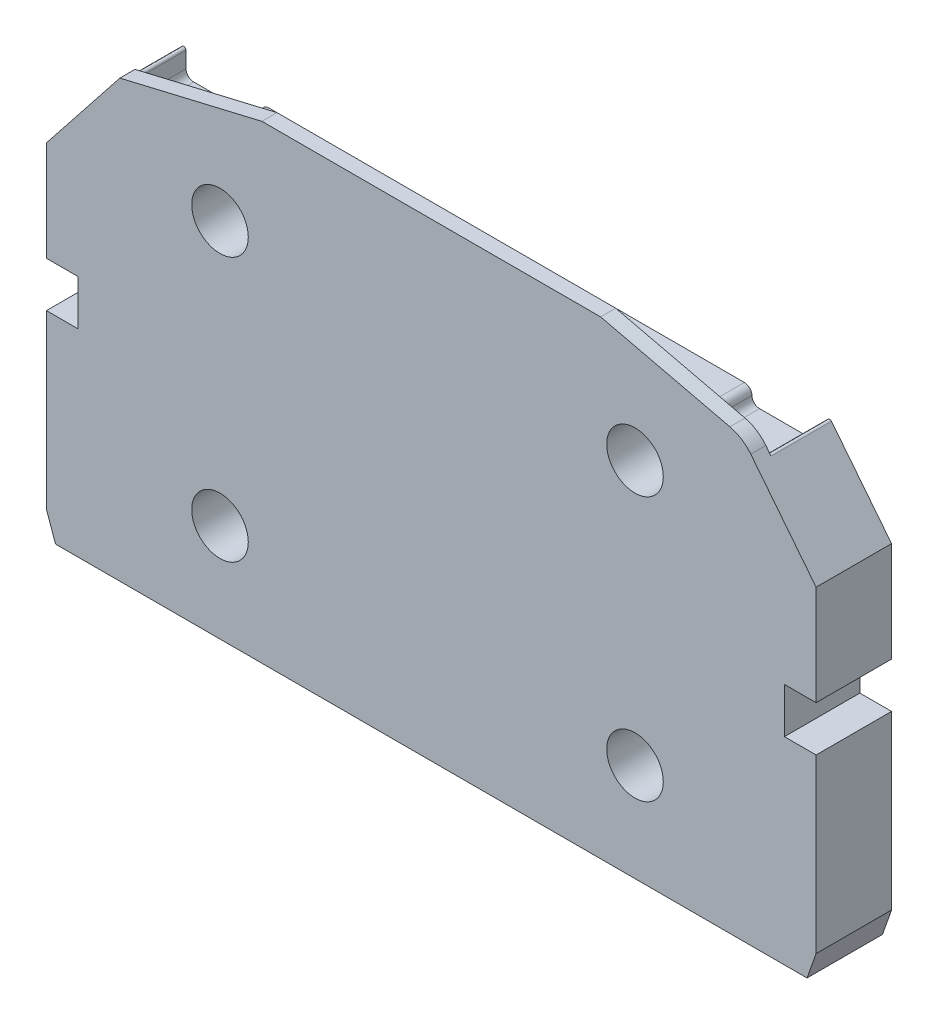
ISO-10303-21;
HEADER;
FILE_DESCRIPTION(('STEP AP214'),'2;1');
FILE_NAME('part.step','',(''),(''),'','','');
FILE_SCHEMA(('AUTOMOTIVE_DESIGN { 1 0 10303 214 1 1 1 1 }'));
ENDSEC;
DATA;
#1=APPLICATION_CONTEXT('core data for automotive mechanical design processes');
#2=APPLICATION_PROTOCOL_DEFINITION('international standard','automotive_design',2000,#1);
#3=PRODUCT_CONTEXT('',#1,'mechanical');
#4=PRODUCT('Part','Part','',(#3));
#5=PRODUCT_RELATED_PRODUCT_CATEGORY('part','',(#4));
#6=PRODUCT_DEFINITION_FORMATION('','',#4);
#7=PRODUCT_DEFINITION_CONTEXT('part definition',#1,'design');
#8=PRODUCT_DEFINITION('design','',#6,#7);
#9=PRODUCT_DEFINITION_SHAPE('','',#8);
#10=(LENGTH_UNIT() NAMED_UNIT(*) SI_UNIT(.MILLI.,.METRE.));
#11=(NAMED_UNIT(*) PLANE_ANGLE_UNIT() SI_UNIT($,.RADIAN.));
#12=(NAMED_UNIT(*) SI_UNIT($,.STERADIAN.) SOLID_ANGLE_UNIT());
#13=UNCERTAINTY_MEASURE_WITH_UNIT(LENGTH_MEASURE(1.E-05),#10,'distance_accuracy_value','');
#14=(GEOMETRIC_REPRESENTATION_CONTEXT(3) GLOBAL_UNCERTAINTY_ASSIGNED_CONTEXT((#13)) GLOBAL_UNIT_ASSIGNED_CONTEXT((#10,
#11,#12)) REPRESENTATION_CONTEXT('',''));
#15=CARTESIAN_POINT('',(0.,0.,0.));
#16=DIRECTION('',(0.,0.,1.));
#17=DIRECTION('',(1.,0.,0.));
#18=AXIS2_PLACEMENT_3D('',#15,#16,#17);
#19=CARTESIAN_POINT('',(29.214069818,-33.713966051,4.5));
#20=DIRECTION('',(0.,0.,1.));
#21=DIRECTION('',(1.,0.,0.));
#22=AXIS2_PLACEMENT_3D('',#19,#20,#21);
#23=CYLINDRICAL_SURFACE('',#22,3.75);
#24=CARTESIAN_POINT('',(29.214069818,-33.713966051,10.));
#25=DIRECTION('',(0.,0.,1.));
#26=DIRECTION('',(1.,0.,0.));
#27=AXIS2_PLACEMENT_3D('',#24,#25,#26);
#28=CIRCLE('',#27,3.75);
#29=CARTESIAN_POINT('',(32.964069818,-33.713966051,10.));
#30=VERTEX_POINT('',#29);
#31=EDGE_CURVE('E568',#30,#30,#28,.F.);
#32=ORIENTED_EDGE('',*,*,#31,.F.);
#33=EDGE_LOOP('',(#32));
#34=FACE_BOUND('',#33,.T.);
#35=CARTESIAN_POINT('',(29.214069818,-33.713966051,4.5));
#36=DIRECTION('',(0.,0.,1.));
#37=DIRECTION('',(1.,0.,0.));
#38=AXIS2_PLACEMENT_3D('',#35,#36,#37);
#39=CIRCLE('',#38,3.75);
#40=CARTESIAN_POINT('',(32.964069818,-33.713966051,4.5));
#41=VERTEX_POINT('',#40);
#42=EDGE_CURVE('E554',#41,#41,#39,.T.);
#43=ORIENTED_EDGE('',*,*,#42,.F.);
#44=EDGE_LOOP('',(#43));
#45=FACE_BOUND('',#44,.T.);
#46=ADVANCED_FACE('F17',(#34,#45),#23,.F.);
#47=CARTESIAN_POINT('',(29.214069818,-68.713966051,4.5));
#48=DIRECTION('',(0.,0.,1.));
#49=DIRECTION('',(1.,0.,0.));
#50=AXIS2_PLACEMENT_3D('',#47,#48,#49);
#51=CYLINDRICAL_SURFACE('',#50,3.75);
#52=CARTESIAN_POINT('',(29.214069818,-68.713966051,10.));
#53=DIRECTION('',(0.,0.,1.));
#54=DIRECTION('',(1.,0.,0.));
#55=AXIS2_PLACEMENT_3D('',#52,#53,#54);
#56=CIRCLE('',#55,3.75);
#57=CARTESIAN_POINT('',(32.964069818,-68.713966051,10.));
#58=VERTEX_POINT('',#57);
#59=EDGE_CURVE('E571',#58,#58,#56,.F.);
#60=ORIENTED_EDGE('',*,*,#59,.F.);
#61=EDGE_LOOP('',(#60));
#62=FACE_BOUND('',#61,.T.);
#63=CARTESIAN_POINT('',(29.214069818,-68.713966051,4.5));
#64=DIRECTION('',(0.,0.,1.));
#65=DIRECTION('',(1.,0.,0.));
#66=AXIS2_PLACEMENT_3D('',#63,#64,#65);
#67=CIRCLE('',#66,3.75);
#68=CARTESIAN_POINT('',(32.964069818,-68.713966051,4.5));
#69=VERTEX_POINT('',#68);
#70=EDGE_CURVE('E551',#69,#69,#67,.T.);
#71=ORIENTED_EDGE('',*,*,#70,.F.);
#72=EDGE_LOOP('',(#71));
#73=FACE_BOUND('',#72,.T.);
#74=ADVANCED_FACE('F835',(#62,#73),#51,.F.);
#75=CARTESIAN_POINT('',(-25.785930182,-68.713966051,4.5));
#76=DIRECTION('',(0.,0.,1.));
#77=DIRECTION('',(1.,0.,0.));
#78=AXIS2_PLACEMENT_3D('',#75,#76,#77);
#79=CYLINDRICAL_SURFACE('',#78,3.75);
#80=CARTESIAN_POINT('',(-25.785930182,-68.713966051,10.));
#81=DIRECTION('',(0.,0.,1.));
#82=DIRECTION('',(1.,0.,0.));
#83=AXIS2_PLACEMENT_3D('',#80,#81,#82);
#84=CIRCLE('',#83,3.75);
#85=CARTESIAN_POINT('',(-22.035930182,-68.713966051,10.));
#86=VERTEX_POINT('',#85);
#87=EDGE_CURVE('E574',#86,#86,#84,.F.);
#88=ORIENTED_EDGE('',*,*,#87,.F.);
#89=EDGE_LOOP('',(#88));
#90=FACE_BOUND('',#89,.T.);
#91=CARTESIAN_POINT('',(-25.785930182,-68.713966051,4.5));
#92=DIRECTION('',(0.,0.,1.));
#93=DIRECTION('',(1.,0.,0.));
#94=AXIS2_PLACEMENT_3D('',#91,#92,#93);
#95=CIRCLE('',#94,3.75);
#96=CARTESIAN_POINT('',(-22.035930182,-68.713966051,4.5));
#97=VERTEX_POINT('',#96);
#98=EDGE_CURVE('E548',#97,#97,#95,.T.);
#99=ORIENTED_EDGE('',*,*,#98,.F.);
#100=EDGE_LOOP('',(#99));
#101=FACE_BOUND('',#100,.T.);
#102=ADVANCED_FACE('F831',(#90,#101),#79,.F.);
#103=CARTESIAN_POINT('',(-25.785930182,-33.713966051,4.5));
#104=DIRECTION('',(0.,0.,1.));
#105=DIRECTION('',(1.,0.,0.));
#106=AXIS2_PLACEMENT_3D('',#103,#104,#105);
#107=CYLINDRICAL_SURFACE('',#106,3.75);
#108=CARTESIAN_POINT('',(-25.785930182,-33.713966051,10.));
#109=DIRECTION('',(0.,0.,1.));
#110=DIRECTION('',(1.,0.,0.));
#111=AXIS2_PLACEMENT_3D('',#108,#109,#110);
#112=CIRCLE('',#111,3.75);
#113=CARTESIAN_POINT('',(-22.035930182,-33.713966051,10.));
#114=VERTEX_POINT('',#113);
#115=EDGE_CURVE('E565',#114,#114,#112,.F.);
#116=ORIENTED_EDGE('',*,*,#115,.F.);
#117=EDGE_LOOP('',(#116));
#118=FACE_BOUND('',#117,.T.);
#119=CARTESIAN_POINT('',(-25.785930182,-33.713966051,4.5));
#120=DIRECTION('',(0.,0.,1.));
#121=DIRECTION('',(1.,0.,0.));
#122=AXIS2_PLACEMENT_3D('',#119,#120,#121);
#123=CIRCLE('',#122,3.75);
#124=CARTESIAN_POINT('',(-22.035930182,-33.713966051,4.5));
#125=VERTEX_POINT('',#124);
#126=EDGE_CURVE('E545',#125,#125,#123,.T.);
#127=ORIENTED_EDGE('',*,*,#126,.F.);
#128=EDGE_LOOP('',(#127));
#129=FACE_BOUND('',#128,.T.);
#130=ADVANCED_FACE('F828',(#118,#129),#107,.F.);
#131=CARTESIAN_POINT('',(-39.285930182,-28.513966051,8.));
#132=DIRECTION('',(0.,0.,-1.));
#133=DIRECTION('',(-1.,0.,0.));
#134=AXIS2_PLACEMENT_3D('',#131,#132,#133);
#135=CYLINDRICAL_SURFACE('',#134,1.);
#136=CARTESIAN_POINT('',(-39.285930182,-28.513966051,8.));
#137=DIRECTION('',(0.,0.,-1.));
#138=DIRECTION('',(-1.,0.,0.));
#139=AXIS2_PLACEMENT_3D('',#136,#137,#138);
#140=CIRCLE('',#139,1.);
#141=CARTESIAN_POINT('',(-40.2859302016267,-28.513966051,8.));
#142=VERTEX_POINT('',#141);
#143=CARTESIAN_POINT('',(-39.285930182,-29.513966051,8.));
#144=VERTEX_POINT('',#143);
#145=EDGE_CURVE('E157',#142,#144,#140,.F.);
#146=ORIENTED_EDGE('',*,*,#145,.T.);
#147=DIRECTION('',(0.,0.,-1.));
#148=VECTOR('',#147,1.);
#149=CARTESIAN_POINT('',(-39.285930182,-29.513966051,4.));
#150=LINE('',#149,#148);
#151=CARTESIAN_POINT('',(-39.285930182,-29.5139660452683,0.));
#152=VERTEX_POINT('',#151);
#153=EDGE_CURVE('E155',#144,#152,#150,.T.);
#154=ORIENTED_EDGE('',*,*,#153,.T.);
#155=CARTESIAN_POINT('',(-39.285930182,-28.513966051,0.));
#156=DIRECTION('',(0.,0.,-1.));
#157=DIRECTION('',(-1.,0.,0.));
#158=AXIS2_PLACEMENT_3D('',#155,#156,#157);
#159=CIRCLE('',#158,1.);
#160=CARTESIAN_POINT('',(-40.285930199,-28.513966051,0.));
#161=VERTEX_POINT('',#160);
#162=EDGE_CURVE('E21',#152,#161,#159,.T.);
#163=ORIENTED_EDGE('',*,*,#162,.T.);
#164=DIRECTION('',(0.,0.,1.));
#165=VECTOR('',#164,1.);
#166=CARTESIAN_POINT('',(-40.285930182,-28.513966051,4.));
#167=LINE('',#166,#165);
#168=EDGE_CURVE('E152',#161,#142,#167,.T.);
#169=ORIENTED_EDGE('',*,*,#168,.T.);
#170=EDGE_LOOP('',(#146,#154,#163,#169));
#171=FACE_BOUND('',#170,.T.);
#172=ADVANCED_FACE('F151',(#171),#135,.F.);
#173=CARTESIAN_POINT('',(-40.585930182,-26.381569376,8.));
#174=DIRECTION('',(0.,0.,-1.));
#175=DIRECTION('',(-1.,0.,0.));
#176=AXIS2_PLACEMENT_3D('',#173,#174,#175);
#177=CYLINDRICAL_SURFACE('',#176,0.300000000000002);
#178=DIRECTION('',(0.,0.,-1.));
#179=VECTOR('',#178,1.);
#180=CARTESIAN_POINT('',(-40.8211875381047,-26.195413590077,5.));
#181=LINE('',#180,#179);
#182=CARTESIAN_POINT('',(-40.8211875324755,-26.1954135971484,8.));
#183=VERTEX_POINT('',#182);
#184=CARTESIAN_POINT('',(-40.8211875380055,-26.1954135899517,0.));
#185=VERTEX_POINT('',#184);
#186=EDGE_CURVE('E368',#183,#185,#181,.T.);
#187=ORIENTED_EDGE('',*,*,#186,.F.);
#188=CARTESIAN_POINT('',(-40.585930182,-26.381569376,8.));
#189=DIRECTION('',(0.,0.,-1.));
#190=DIRECTION('',(-1.,0.,0.));
#191=AXIS2_PLACEMENT_3D('',#188,#189,#190);
#192=CIRCLE('',#191,0.300000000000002);
#193=CARTESIAN_POINT('',(-40.2859302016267,-26.381569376,8.));
#194=VERTEX_POINT('',#193);
#195=EDGE_CURVE('E578',#194,#183,#192,.F.);
#196=ORIENTED_EDGE('',*,*,#195,.F.);
#197=DIRECTION('',(0.,0.,-1.));
#198=VECTOR('',#197,1.);
#199=CARTESIAN_POINT('',(-40.285930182,-26.381569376,4.));
#200=LINE('',#199,#198);
#201=CARTESIAN_POINT('',(-40.285930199,-26.381569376,0.));
#202=VERTEX_POINT('',#201);
#203=EDGE_CURVE('E165',#194,#202,#200,.T.);
#204=ORIENTED_EDGE('',*,*,#203,.T.);
#205=CARTESIAN_POINT('',(-40.585930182,-26.381569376,0.));
#206=DIRECTION('',(0.,0.,-1.));
#207=DIRECTION('',(-1.,0.,0.));
#208=AXIS2_PLACEMENT_3D('',#205,#206,#207);
#209=CIRCLE('',#208,0.300000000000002);
#210=EDGE_CURVE('E169',#185,#202,#209,.T.);
#211=ORIENTED_EDGE('',*,*,#210,.F.);
#212=EDGE_LOOP('',(#187,#196,#204,#211));
#213=FACE_BOUND('',#212,.T.);
#214=ADVANCED_FACE('F737',(#213),#177,.T.);
#215=CARTESIAN_POINT('',(-48.785930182,-81.713966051,10.));
#216=DIRECTION('',(0.,0.,1.));
#217=DIRECTION('',(1.,0.,0.));
#218=AXIS2_PLACEMENT_3D('',#215,#216,#217);
#219=PLANE('',#218);
#220=ORIENTED_EDGE('',*,*,#115,.T.);
#221=EDGE_LOOP('',(#220));
#222=FACE_BOUND('',#221,.T.);
#223=ORIENTED_EDGE('',*,*,#31,.T.);
#224=EDGE_LOOP('',(#223));
#225=FACE_BOUND('',#224,.T.);
#226=ORIENTED_EDGE('',*,*,#59,.T.);
#227=EDGE_LOOP('',(#226));
#228=FACE_BOUND('',#227,.T.);
#229=ORIENTED_EDGE('',*,*,#87,.T.);
#230=EDGE_LOOP('',(#229));
#231=FACE_BOUND('',#230,.T.);
#232=DIRECTION('',(-1.,0.,0.));
#233=VECTOR('',#232,1.);
#234=CARTESIAN_POINT('',(-46.685930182,-49.513966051,10.));
#235=LINE('',#234,#233);
#236=CARTESIAN_POINT('',(-44.585930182,-49.513966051,10.));
#237=VERTEX_POINT('',#236);
#238=CARTESIAN_POINT('',(-48.785930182,-49.513966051,10.));
#239=VERTEX_POINT('',#238);
#240=EDGE_CURVE('E354',#237,#239,#235,.T.);
#241=ORIENTED_EDGE('',*,*,#240,.F.);
#242=DIRECTION('',(0.,-1.,0.));
#243=VECTOR('',#242,1.);
#244=CARTESIAN_POINT('',(-44.585930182,-52.513966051,10.));
#245=LINE('',#244,#243);
#246=CARTESIAN_POINT('',(-44.585930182,-55.513966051,10.));
#247=VERTEX_POINT('',#246);
#248=EDGE_CURVE('E334',#237,#247,#245,.T.);
#249=ORIENTED_EDGE('',*,*,#248,.T.);
#250=DIRECTION('',(-1.,0.,0.));
#251=VECTOR('',#250,1.);
#252=CARTESIAN_POINT('',(-46.685930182,-55.513966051,10.));
#253=LINE('',#252,#251);
#254=CARTESIAN_POINT('',(-48.785930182,-55.513966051,10.));
#255=VERTEX_POINT('',#254);
#256=EDGE_CURVE('E323',#247,#255,#253,.T.);
#257=ORIENTED_EDGE('',*,*,#256,.T.);
#258=DIRECTION('',(0.,-1.,0.));
#259=VECTOR('',#258,1.);
#260=CARTESIAN_POINT('',(-48.785930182,-66.913966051,10.));
#261=LINE('',#260,#259);
#262=CARTESIAN_POINT('',(-48.785930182,-78.313966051,10.));
#263=VERTEX_POINT('',#262);
#264=EDGE_CURVE('E322',#255,#263,#261,.T.);
#265=ORIENTED_EDGE('',*,*,#264,.T.);
#266=DIRECTION('',(-0.332820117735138,0.942990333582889,0.));
#267=VECTOR('',#266,1.);
#268=CARTESIAN_POINT('',(-48.185930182,-80.013966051,10.));
#269=LINE('',#268,#267);
#270=CARTESIAN_POINT('',(-47.585930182,-81.713966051,10.));
#271=VERTEX_POINT('',#270);
#272=EDGE_CURVE('E310',#271,#263,#269,.T.);
#273=ORIENTED_EDGE('',*,*,#272,.F.);
#274=DIRECTION('',(1.,0.,0.));
#275=VECTOR('',#274,1.);
#276=CARTESIAN_POINT('',(2.214069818,-81.713966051,10.));
#277=LINE('',#276,#275);
#278=CARTESIAN_POINT('',(52.014069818,-81.713966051,10.));
#279=VERTEX_POINT('',#278);
#280=EDGE_CURVE('E304',#271,#279,#277,.T.);
#281=ORIENTED_EDGE('',*,*,#280,.T.);
#282=DIRECTION('',(-0.332820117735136,-0.94299033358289,0.));
#283=VECTOR('',#282,1.);
#284=CARTESIAN_POINT('',(52.614069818,-80.013966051,10.));
#285=LINE('',#284,#283);
#286=CARTESIAN_POINT('',(53.214069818,-78.313966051,10.));
#287=VERTEX_POINT('',#286);
#288=EDGE_CURVE('E294',#287,#279,#285,.T.);
#289=ORIENTED_EDGE('',*,*,#288,.F.);
#290=DIRECTION('',(0.,1.,0.));
#291=VECTOR('',#290,1.);
#292=CARTESIAN_POINT('',(53.214069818,-66.913966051,10.));
#293=LINE('',#292,#291);
#294=CARTESIAN_POINT('',(53.214069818,-55.513966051,10.));
#295=VERTEX_POINT('',#294);
#296=EDGE_CURVE('E288',#287,#295,#293,.T.);
#297=ORIENTED_EDGE('',*,*,#296,.T.);
#298=DIRECTION('',(1.,0.,0.));
#299=VECTOR('',#298,1.);
#300=CARTESIAN_POINT('',(51.114069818,-55.513966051,10.));
#301=LINE('',#300,#299);
#302=CARTESIAN_POINT('',(49.014069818,-55.513966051,10.));
#303=VERTEX_POINT('',#302);
#304=EDGE_CURVE('E277',#303,#295,#301,.T.);
#305=ORIENTED_EDGE('',*,*,#304,.F.);
#306=DIRECTION('',(0.,-1.,0.));
#307=VECTOR('',#306,1.);
#308=CARTESIAN_POINT('',(49.014069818,-52.513966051,10.));
#309=LINE('',#308,#307);
#310=CARTESIAN_POINT('',(49.014069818,-49.513966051,10.));
#311=VERTEX_POINT('',#310);
#312=EDGE_CURVE('E266',#311,#303,#309,.T.);
#313=ORIENTED_EDGE('',*,*,#312,.F.);
#314=DIRECTION('',(1.,0.,0.));
#315=VECTOR('',#314,1.);
#316=CARTESIAN_POINT('',(51.114069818,-49.513966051,10.));
#317=LINE('',#316,#315);
#318=CARTESIAN_POINT('',(53.214069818,-49.513966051,10.));
#319=VERTEX_POINT('',#318);
#320=EDGE_CURVE('E245',#311,#319,#317,.T.);
#321=ORIENTED_EDGE('',*,*,#320,.T.);
#322=DIRECTION('',(0.,1.,0.));
#323=VECTOR('',#322,1.);
#324=CARTESIAN_POINT('',(53.214069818,-42.887475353,10.));
#325=LINE('',#324,#323);
#326=CARTESIAN_POINT('',(53.214069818,-36.260984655,10.));
#327=VERTEX_POINT('',#326);
#328=EDGE_CURVE('E229',#319,#327,#325,.T.);
#329=ORIENTED_EDGE('',*,*,#328,.T.);
#330=DIRECTION('',(0.620519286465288,-0.784191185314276,0.));
#331=VECTOR('',#330,1.);
#332=CARTESIAN_POINT('',(48.887534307,-30.7932561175,10.));
#333=LINE('',#332,#331);
#334=CARTESIAN_POINT('',(44.5609987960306,-25.3255275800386,10.));
#335=VERTEX_POINT('',#334);
#336=EDGE_CURVE('E232',#335,#327,#333,.T.);
#337=ORIENTED_EDGE('',*,*,#336,.F.);
#338=CARTESIAN_POINT('',(40.64004287,-28.428124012,10.));
#339=DIRECTION('',(0.,0.,-1.));
#340=DIRECTION('',(0.,1.,0.));
#341=AXIS2_PLACEMENT_3D('',#338,#339,#340);
#342=CIRCLE('',#341,5.);
#343=CARTESIAN_POINT('',(41.7896010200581,-23.5620664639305,10.));
#344=VERTEX_POINT('',#343);
#345=EDGE_CURVE('E395',#335,#344,#342,.F.);
#346=ORIENTED_EDGE('',*,*,#345,.T.);
#347=DIRECTION('',(0.973211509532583,-0.229911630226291,0.));
#348=VECTOR('',#347,1.);
#349=CARTESIAN_POINT('',(33.2218354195,-21.5380162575,10.));
#350=LINE('',#349,#348);
#351=CARTESIAN_POINT('',(24.654069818,-19.513966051,10.));
#352=VERTEX_POINT('',#351);
#353=EDGE_CURVE('E399',#352,#344,#350,.T.);
#354=ORIENTED_EDGE('',*,*,#353,.F.);
#355=DIRECTION('',(-1.,0.,0.));
#356=VECTOR('',#355,1.);
#357=CARTESIAN_POINT('',(2.214069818,-19.513966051,10.));
#358=LINE('',#357,#356);
#359=CARTESIAN_POINT('',(-20.225930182,-19.513966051,10.));
#360=VERTEX_POINT('',#359);
#361=EDGE_CURVE('E409',#352,#360,#358,.T.);
#362=ORIENTED_EDGE('',*,*,#361,.T.);
#363=DIRECTION('',(-0.973211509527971,-0.229911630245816,0.));
#364=VECTOR('',#363,1.);
#365=CARTESIAN_POINT('',(-29.6398726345,-21.7379172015,10.));
#366=LINE('',#365,#364);
#367=CARTESIAN_POINT('',(-39.053815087,-23.961868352,10.));
#368=VERTEX_POINT('',#367);
#369=EDGE_CURVE('E475',#360,#368,#366,.T.);
#370=ORIENTED_EDGE('',*,*,#369,.T.);
#371=DIRECTION('',(0.620519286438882,0.784191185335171,0.));
#372=VECTOR('',#371,1.);
#373=CARTESIAN_POINT('',(-43.9198726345,-30.1114265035,10.));
#374=LINE('',#373,#372);
#375=CARTESIAN_POINT('',(-48.785930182,-36.260984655,10.));
#376=VERTEX_POINT('',#375);
#377=EDGE_CURVE('E370',#376,#368,#374,.T.);
#378=ORIENTED_EDGE('',*,*,#377,.F.);
#379=DIRECTION('',(0.,-1.,0.));
#380=VECTOR('',#379,1.);
#381=CARTESIAN_POINT('',(-48.785930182,-42.887475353,10.));
#382=LINE('',#381,#380);
#383=EDGE_CURVE('E364',#376,#239,#382,.T.);
#384=ORIENTED_EDGE('',*,*,#383,.T.);
#385=EDGE_LOOP('',(#241,#249,#257,#265,#273,#281,#289,#297,#305,#313,#321,#329,#337,#346,#354,
#362,#370,#378,#384));
#386=FACE_BOUND('',#385,.T.);
#387=ADVANCED_FACE('F757',(#222,#225,#228,#231,#386),#219,.T.);
#388=CARTESIAN_POINT('',(45.014069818,-26.381569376,8.));
#389=DIRECTION('',(0.,0.,-1.));
#390=DIRECTION('',(-1.,0.,0.));
#391=AXIS2_PLACEMENT_3D('',#388,#389,#390);
#392=CYLINDRICAL_SURFACE('',#391,0.300000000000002);
#393=DIRECTION('',(0.,0.,1.));
#394=VECTOR('',#393,1.);
#395=CARTESIAN_POINT('',(44.714069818,-26.381569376,4.));
#396=LINE('',#395,#394);
#397=CARTESIAN_POINT('',(44.714069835,-26.381569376,0.));
#398=VERTEX_POINT('',#397);
#399=CARTESIAN_POINT('',(44.7140698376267,-26.381569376,8.));
#400=VERTEX_POINT('',#399);
#401=EDGE_CURVE('E217',#398,#400,#396,.T.);
#402=ORIENTED_EDGE('',*,*,#401,.T.);
#403=CARTESIAN_POINT('',(45.014069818,-26.381569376,8.));
#404=DIRECTION('',(0.,0.,-1.));
#405=DIRECTION('',(-1.,0.,0.));
#406=AXIS2_PLACEMENT_3D('',#403,#404,#405);
#407=CIRCLE('',#406,0.300000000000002);
#408=CARTESIAN_POINT('',(45.2493271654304,-26.1954135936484,8.));
#409=VERTEX_POINT('',#408);
#410=EDGE_CURVE('E563',#409,#400,#407,.F.);
#411=ORIENTED_EDGE('',*,*,#410,.F.);
#412=DIRECTION('',(0.,0.,1.));
#413=VECTOR('',#412,1.);
#414=CARTESIAN_POINT('',(45.2493271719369,-26.1954135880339,5.));
#415=LINE('',#414,#413);
#416=CARTESIAN_POINT('',(45.249327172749,-26.1954135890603,0.));
#417=VERTEX_POINT('',#416);
#418=EDGE_CURVE('E225',#417,#409,#415,.T.);
#419=ORIENTED_EDGE('',*,*,#418,.F.);
#420=CARTESIAN_POINT('',(45.014069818,-26.381569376,0.));
#421=DIRECTION('',(0.,0.,-1.));
#422=DIRECTION('',(-1.,0.,0.));
#423=AXIS2_PLACEMENT_3D('',#420,#421,#422);
#424=CIRCLE('',#423,0.300000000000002);
#425=EDGE_CURVE('E561',#398,#417,#424,.T.);
#426=ORIENTED_EDGE('',*,*,#425,.F.);
#427=EDGE_LOOP('',(#402,#411,#419,#426));
#428=FACE_BOUND('',#427,.T.);
#429=ADVANCED_FACE('F618',(#428),#392,.T.);
#430=CARTESIAN_POINT('',(43.714069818,-28.513966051,8.));
#431=DIRECTION('',(0.,0.,-1.));
#432=DIRECTION('',(-1.,0.,0.));
#433=AXIS2_PLACEMENT_3D('',#430,#431,#432);
#434=CYLINDRICAL_SURFACE('',#433,1.);
#435=CARTESIAN_POINT('',(43.714069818,-28.513966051,8.));
#436=DIRECTION('',(0.,0.,-1.));
#437=DIRECTION('',(-1.,0.,0.));
#438=AXIS2_PLACEMENT_3D('',#435,#436,#437);
#439=CIRCLE('',#438,1.);
#440=CARTESIAN_POINT('',(43.714069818,-29.513966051,8.));
#441=VERTEX_POINT('',#440);
#442=CARTESIAN_POINT('',(44.7140698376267,-28.513966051,8.));
#443=VERTEX_POINT('',#442);
#444=EDGE_CURVE('E557',#441,#443,#439,.F.);
#445=ORIENTED_EDGE('',*,*,#444,.T.);
#446=DIRECTION('',(0.,0.,-1.));
#447=VECTOR('',#446,1.);
#448=CARTESIAN_POINT('',(44.714069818,-28.513966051,4.));
#449=LINE('',#448,#447);
#450=CARTESIAN_POINT('',(44.714069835,-28.513966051,0.));
#451=VERTEX_POINT('',#450);
#452=EDGE_CURVE('E220',#443,#451,#449,.T.);
#453=ORIENTED_EDGE('',*,*,#452,.T.);
#454=CARTESIAN_POINT('',(43.714069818,-28.513966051,0.));
#455=DIRECTION('',(0.,0.,-1.));
#456=DIRECTION('',(-1.,0.,0.));
#457=AXIS2_PLACEMENT_3D('',#454,#455,#456);
#458=CIRCLE('',#457,1.);
#459=CARTESIAN_POINT('',(43.714069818,-29.5139660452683,0.));
#460=VERTEX_POINT('',#459);
#461=EDGE_CURVE('E559',#451,#460,#458,.T.);
#462=ORIENTED_EDGE('',*,*,#461,.T.);
#463=DIRECTION('',(0.,0.,1.));
#464=VECTOR('',#463,1.);
#465=CARTESIAN_POINT('',(43.714069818,-29.513966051,4.));
#466=LINE('',#465,#464);
#467=EDGE_CURVE('E384',#460,#441,#466,.T.);
#468=ORIENTED_EDGE('',*,*,#467,.T.);
#469=EDGE_LOOP('',(#445,#453,#462,#468));
#470=FACE_BOUND('',#469,.T.);
#471=ADVANCED_FACE('F607',(#470),#434,.F.);
#472=CARTESIAN_POINT('',(-26.405930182,-61.333966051,5.));
#473=DIRECTION('',(0.,0.,1.));
#474=DIRECTION('',(1.,0.,0.));
#475=AXIS2_PLACEMENT_3D('',#472,#473,#474);
#476=PLANE('',#475);
#477=CARTESIAN_POINT('',(-16.285930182,-51.213966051,5.));
#478=DIRECTION('',(0.,0.,-1.));
#479=DIRECTION('',(0.,1.,0.));
#480=AXIS2_PLACEMENT_3D('',#477,#478,#479);
#481=CIRCLE('',#480,10.);
#482=CARTESIAN_POINT('',(-16.285930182,-41.213966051,5.));
#483=VERTEX_POINT('',#482);
#484=EDGE_CURVE('E224',#483,#483,#481,.F.);
#485=ORIENTED_EDGE('',*,*,#484,.F.);
#486=EDGE_LOOP('',(#485));
#487=FACE_BOUND('',#486,.T.);
#488=ADVANCED_FACE('F821',(#487),#476,.F.);
#489=CARTESIAN_POINT('',(25.419069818,-37.508966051,4.5));
#490=DIRECTION('',(0.,0.,1.));
#491=DIRECTION('',(1.,0.,0.));
#492=AXIS2_PLACEMENT_3D('',#489,#490,#491);
#493=PLANE('',#492);
#494=CARTESIAN_POINT('',(29.214069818,-33.713966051,4.5));
#495=DIRECTION('',(0.,0.,1.));
#496=DIRECTION('',(1.,0.,0.));
#497=AXIS2_PLACEMENT_3D('',#494,#495,#496);
#498=CIRCLE('',#497,2.25);
#499=CARTESIAN_POINT('',(31.464069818,-33.713966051,4.5));
#500=VERTEX_POINT('',#499);
#501=EDGE_CURVE('E534',#500,#500,#498,.T.);
#502=ORIENTED_EDGE('',*,*,#501,.F.);
#503=EDGE_LOOP('',(#502));
#504=FACE_BOUND('',#503,.T.);
#505=ORIENTED_EDGE('',*,*,#42,.T.);
#506=EDGE_LOOP('',(#505));
#507=FACE_BOUND('',#506,.T.);
#508=ADVANCED_FACE('F848',(#504,#507),#493,.T.);
#509=CARTESIAN_POINT('',(25.419069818,-72.508966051,4.5));
#510=DIRECTION('',(0.,0.,1.));
#511=DIRECTION('',(1.,0.,0.));
#512=AXIS2_PLACEMENT_3D('',#509,#510,#511);
#513=PLANE('',#512);
#514=CARTESIAN_POINT('',(29.214069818,-68.713966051,4.5));
#515=DIRECTION('',(0.,0.,1.));
#516=DIRECTION('',(1.,0.,0.));
#517=AXIS2_PLACEMENT_3D('',#514,#515,#516);
#518=CIRCLE('',#517,2.25);
#519=CARTESIAN_POINT('',(31.464069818,-68.713966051,4.5));
#520=VERTEX_POINT('',#519);
#521=EDGE_CURVE('E531',#520,#520,#518,.T.);
#522=ORIENTED_EDGE('',*,*,#521,.F.);
#523=EDGE_LOOP('',(#522));
#524=FACE_BOUND('',#523,.T.);
#525=ORIENTED_EDGE('',*,*,#70,.T.);
#526=EDGE_LOOP('',(#525));
#527=FACE_BOUND('',#526,.T.);
#528=ADVANCED_FACE('F852',(#524,#527),#513,.T.);
#529=CARTESIAN_POINT('',(-29.580930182,-72.508966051,4.5));
#530=DIRECTION('',(0.,0.,1.));
#531=DIRECTION('',(1.,0.,0.));
#532=AXIS2_PLACEMENT_3D('',#529,#530,#531);
#533=PLANE('',#532);
#534=CARTESIAN_POINT('',(-25.785930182,-68.713966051,4.5));
#535=DIRECTION('',(0.,0.,1.));
#536=DIRECTION('',(1.,0.,0.));
#537=AXIS2_PLACEMENT_3D('',#534,#535,#536);
#538=CIRCLE('',#537,2.25);
#539=CARTESIAN_POINT('',(-23.535930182,-68.713966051,4.5));
#540=VERTEX_POINT('',#539);
#541=EDGE_CURVE('E528',#540,#540,#538,.T.);
#542=ORIENTED_EDGE('',*,*,#541,.F.);
#543=EDGE_LOOP('',(#542));
#544=FACE_BOUND('',#543,.T.);
#545=ORIENTED_EDGE('',*,*,#98,.T.);
#546=EDGE_LOOP('',(#545));
#547=FACE_BOUND('',#546,.T.);
#548=ADVANCED_FACE('F856',(#544,#547),#533,.T.);
#549=CARTESIAN_POINT('',(-29.580930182,-37.508966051,4.5));
#550=DIRECTION('',(0.,0.,1.));
#551=DIRECTION('',(1.,0.,0.));
#552=AXIS2_PLACEMENT_3D('',#549,#550,#551);
#553=PLANE('',#552);
#554=CARTESIAN_POINT('',(-25.785930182,-33.713966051,4.5));
#555=DIRECTION('',(0.,0.,1.));
#556=DIRECTION('',(1.,0.,0.));
#557=AXIS2_PLACEMENT_3D('',#554,#555,#556);
#558=CIRCLE('',#557,2.25);
#559=CARTESIAN_POINT('',(-23.535930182,-33.713966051,4.5));
#560=VERTEX_POINT('',#559);
#561=EDGE_CURVE('E383',#560,#560,#558,.T.);
#562=ORIENTED_EDGE('',*,*,#561,.F.);
#563=EDGE_LOOP('',(#562));
#564=FACE_BOUND('',#563,.T.);
#565=ORIENTED_EDGE('',*,*,#126,.T.);
#566=EDGE_LOOP('',(#565));
#567=FACE_BOUND('',#566,.T.);
#568=ADVANCED_FACE('F818',(#564,#567),#553,.T.);
#569=CARTESIAN_POINT('',(35.714069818,-28.513966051,8.));
#570=DIRECTION('',(0.,0.,-1.));
#571=DIRECTION('',(-1.,0.,0.));
#572=AXIS2_PLACEMENT_3D('',#569,#570,#571);
#573=CYLINDRICAL_SURFACE('',#572,1.);
#574=CARTESIAN_POINT('',(35.714069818,-28.513966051,8.));
#575=DIRECTION('',(0.,0.,-1.));
#576=DIRECTION('',(-1.,0.,0.));
#577=AXIS2_PLACEMENT_3D('',#574,#575,#576);
#578=CIRCLE('',#577,1.);
#579=CARTESIAN_POINT('',(34.714069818,-28.5139660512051,8.));
#580=VERTEX_POINT('',#579);
#581=CARTESIAN_POINT('',(35.714069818,-29.513966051,8.));
#582=VERTEX_POINT('',#581);
#583=EDGE_CURVE('E478',#580,#582,#578,.F.);
#584=ORIENTED_EDGE('',*,*,#583,.T.);
#585=DIRECTION('',(0.,0.,-1.));
#586=VECTOR('',#585,1.);
#587=CARTESIAN_POINT('',(35.714069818,-29.513966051,4.));
#588=LINE('',#587,#586);
#589=CARTESIAN_POINT('',(35.714069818,-29.5139660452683,0.));
#590=VERTEX_POINT('',#589);
#591=EDGE_CURVE('E376',#582,#590,#588,.T.);
#592=ORIENTED_EDGE('',*,*,#591,.T.);
#593=CARTESIAN_POINT('',(35.714069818,-28.513966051,0.));
#594=DIRECTION('',(0.,0.,-1.));
#595=DIRECTION('',(-1.,0.,0.));
#596=AXIS2_PLACEMENT_3D('',#593,#594,#595);
#597=CIRCLE('',#596,1.);
#598=CARTESIAN_POINT('',(34.714069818,-28.5139660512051,0.));
#599=VERTEX_POINT('',#598);
#600=EDGE_CURVE('E543',#590,#599,#597,.T.);
#601=ORIENTED_EDGE('',*,*,#600,.T.);
#602=DIRECTION('',(0.,0.,-1.));
#603=VECTOR('',#602,1.);
#604=CARTESIAN_POINT('',(34.714069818,-28.5139660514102,4.));
#605=LINE('',#604,#603);
#606=EDGE_CURVE('E213',#599,#580,#605,.F.);
#607=ORIENTED_EDGE('',*,*,#606,.T.);
#608=EDGE_LOOP('',(#584,#592,#601,#607));
#609=FACE_BOUND('',#608,.T.);
#610=ADVANCED_FACE('F601',(#609),#573,.F.);
#611=CARTESIAN_POINT('',(-39.053815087,-23.961868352,8.));
#612=DIRECTION('',(0.229911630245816,-0.97321150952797,0.));
#613=DIRECTION('',(0.97321150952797,0.229911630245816,0.));
#614=AXIS2_PLACEMENT_3D('',#611,#612,#613);
#615=PLANE('',#614);
#616=DIRECTION('',(0.,0.,-1.));
#617=VECTOR('',#616,1.);
#618=CARTESIAN_POINT('',(-39.053815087,-23.961868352,5.));
#619=LINE('',#618,#617);
#620=CARTESIAN_POINT('',(-39.0538151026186,-23.961868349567,8.));
#621=VERTEX_POINT('',#620);
#622=EDGE_CURVE('E365',#368,#621,#619,.T.);
#623=ORIENTED_EDGE('',*,*,#622,.F.);
#624=ORIENTED_EDGE('',*,*,#369,.F.);
#625=DIRECTION('',(0.,0.,-1.));
#626=VECTOR('',#625,1.);
#627=CARTESIAN_POINT('',(-20.225930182,-19.513966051,9.));
#628=LINE('',#627,#626);
#629=CARTESIAN_POINT('',(-20.2259302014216,-19.513966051,8.));
#630=VERTEX_POINT('',#629);
#631=EDGE_CURVE('E400',#360,#630,#628,.T.);
#632=ORIENTED_EDGE('',*,*,#631,.T.);
#633=DIRECTION('',(0.973211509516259,0.229911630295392,0.));
#634=VECTOR('',#633,1.);
#635=CARTESIAN_POINT('',(-39.0538151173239,-23.961868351,8.));
#636=LINE('',#635,#634);
#637=EDGE_CURVE('E406',#621,#630,#636,.T.);
#638=ORIENTED_EDGE('',*,*,#637,.F.);
#639=EDGE_LOOP('',(#623,#624,#632,#638));
#640=FACE_BOUND('',#639,.T.);
#641=ADVANCED_FACE('F741',(#640),#615,.F.);
#642=CARTESIAN_POINT('',(-20.225930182,-19.513966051,10.));
#643=DIRECTION('',(0.,-1.,0.));
#644=DIRECTION('',(0.,0.,-1.));
#645=AXIS2_PLACEMENT_3D('',#642,#643,#644);
#646=PLANE('',#645);
#647=ORIENTED_EDGE('',*,*,#631,.F.);
#648=ORIENTED_EDGE('',*,*,#361,.F.);
#649=DIRECTION('',(0.,0.,1.));
#650=VECTOR('',#649,1.);
#651=CARTESIAN_POINT('',(24.654069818,-19.513966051,9.));
#652=LINE('',#651,#650);
#653=CARTESIAN_POINT('',(24.6540698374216,-19.513966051,8.));
#654=VERTEX_POINT('',#653);
#655=EDGE_CURVE('E396',#654,#352,#652,.T.);
#656=ORIENTED_EDGE('',*,*,#655,.F.);
#657=DIRECTION('',(1.,0.,0.));
#658=VECTOR('',#657,1.);
#659=CARTESIAN_POINT('',(2.21406981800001,-19.513966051,8.));
#660=LINE('',#659,#658);
#661=EDGE_CURVE('E403',#630,#654,#660,.T.);
#662=ORIENTED_EDGE('',*,*,#661,.F.);
#663=EDGE_LOOP('',(#647,#648,#656,#662));
#664=FACE_BOUND('',#663,.T.);
#665=ADVANCED_FACE('F746',(#664),#646,.F.);
#666=CARTESIAN_POINT('',(41.789601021,-23.562066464,8.));
#667=DIRECTION('',(0.229911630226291,0.973211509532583,0.));
#668=DIRECTION('',(-0.973211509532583,0.229911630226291,0.));
#669=AXIS2_PLACEMENT_3D('',#666,#667,#668);
#670=PLANE('',#669);
#671=ORIENTED_EDGE('',*,*,#655,.T.);
#672=ORIENTED_EDGE('',*,*,#353,.T.);
#673=DIRECTION('',(0.,0.,1.));
#674=VECTOR('',#673,1.);
#675=CARTESIAN_POINT('',(41.7896010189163,-23.5620664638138,9.));
#676=LINE('',#675,#674);
#677=CARTESIAN_POINT('',(41.789601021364,-23.5620664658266,8.));
#678=VERTEX_POINT('',#677);
#679=EDGE_CURVE('E392',#344,#678,#676,.F.);
#680=ORIENTED_EDGE('',*,*,#679,.T.);
#681=DIRECTION('',(0.97321150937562,-0.229911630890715,0.));
#682=VECTOR('',#681,1.);
#683=CARTESIAN_POINT('',(24.6540698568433,-19.513966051,8.));
#684=LINE('',#683,#682);
#685=EDGE_CURVE('E405',#654,#678,#684,.T.);
#686=ORIENTED_EDGE('',*,*,#685,.F.);
#687=EDGE_LOOP('',(#671,#672,#680,#686));
#688=FACE_BOUND('',#687,.T.);
#689=ADVANCED_FACE('F752',(#688),#670,.T.);
#690=CARTESIAN_POINT('',(40.64004287,-28.428124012,10.));
#691=DIRECTION('',(0.,0.,-1.));
#692=DIRECTION('',(0.,1.,0.));
#693=AXIS2_PLACEMENT_3D('',#690,#691,#692);
#694=CYLINDRICAL_SURFACE('',#693,5.);
#695=ORIENTED_EDGE('',*,*,#679,.F.);
#696=ORIENTED_EDGE('',*,*,#345,.F.);
#697=DIRECTION('',(0.,0.,1.));
#698=VECTOR('',#697,1.);
#699=CARTESIAN_POINT('',(44.560998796,-25.32552758,5.));
#700=LINE('',#699,#698);
#701=CARTESIAN_POINT('',(44.5609987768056,-25.3255275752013,8.));
#702=VERTEX_POINT('',#701);
#703=EDGE_CURVE('E228',#702,#335,#700,.T.);
#704=ORIENTED_EDGE('',*,*,#703,.F.);
#705=CARTESIAN_POINT('',(40.64004287,-28.428124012,8.));
#706=DIRECTION('',(0.,0.,-1.));
#707=DIRECTION('',(0.,1.,0.));
#708=AXIS2_PLACEMENT_3D('',#705,#706,#707);
#709=CIRCLE('',#708,5.);
#710=EDGE_CURVE('E518',#678,#702,#709,.T.);
#711=ORIENTED_EDGE('',*,*,#710,.F.);
#712=EDGE_LOOP('',(#695,#696,#704,#711));
#713=FACE_BOUND('',#712,.T.);
#714=ADVANCED_FACE('F755',(#713),#694,.T.);
#715=CARTESIAN_POINT('',(-31.285930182,-28.513966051,8.));
#716=DIRECTION('',(0.,0.,-1.));
#717=DIRECTION('',(-1.,0.,0.));
#718=AXIS2_PLACEMENT_3D('',#715,#716,#717);
#719=CYLINDRICAL_SURFACE('',#718,1.00000000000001);
#720=CARTESIAN_POINT('',(-31.285930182,-28.513966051,8.));
#721=DIRECTION('',(0.,0.,-1.));
#722=DIRECTION('',(-1.,0.,0.));
#723=AXIS2_PLACEMENT_3D('',#720,#721,#722);
#724=CIRCLE('',#723,1.00000000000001);
#725=CARTESIAN_POINT('',(-30.285930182,-28.513966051,8.));
#726=VERTEX_POINT('',#725);
#727=CARTESIAN_POINT('',(-31.285930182,-29.513966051,8.));
#728=VERTEX_POINT('',#727);
#729=EDGE_CURVE('E205',#726,#728,#724,.T.);
#730=ORIENTED_EDGE('',*,*,#729,.F.);
#731=DIRECTION('',(0.,0.,1.));
#732=VECTOR('',#731,1.);
#733=CARTESIAN_POINT('',(-30.285930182,-28.513966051,4.));
#734=LINE('',#733,#732);
#735=CARTESIAN_POINT('',(-30.285930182,-28.513966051,0.));
#736=VERTEX_POINT('',#735);
#737=EDGE_CURVE('E186',#726,#736,#734,.F.);
#738=ORIENTED_EDGE('',*,*,#737,.T.);
#739=CARTESIAN_POINT('',(-31.285930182,-28.513966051,0.));
#740=DIRECTION('',(0.,0.,-1.));
#741=DIRECTION('',(-1.,0.,0.));
#742=AXIS2_PLACEMENT_3D('',#739,#740,#741);
#743=CIRCLE('',#742,1.00000000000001);
#744=CARTESIAN_POINT('',(-31.285930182,-29.5139660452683,0.));
#745=VERTEX_POINT('',#744);
#746=EDGE_CURVE('E387',#736,#745,#743,.T.);
#747=ORIENTED_EDGE('',*,*,#746,.T.);
#748=DIRECTION('',(0.,0.,1.));
#749=VECTOR('',#748,1.);
#750=CARTESIAN_POINT('',(-31.285930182,-29.513966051,4.));
#751=LINE('',#750,#749);
#752=EDGE_CURVE('E373',#745,#728,#751,.T.);
#753=ORIENTED_EDGE('',*,*,#752,.T.);
#754=EDGE_LOOP('',(#730,#738,#747,#753));
#755=FACE_BOUND('',#754,.T.);
#756=ADVANCED_FACE('F587',(#755),#719,.F.);
#757=CARTESIAN_POINT('',(35.714069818,-29.513966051,0.));
#758=DIRECTION('',(0.,-1.,0.));
#759=DIRECTION('',(1.,0.,0.));
#760=AXIS2_PLACEMENT_3D('',#757,#758,#759);
#761=PLANE('',#760);
#762=ORIENTED_EDGE('',*,*,#591,.F.);
#763=DIRECTION('',(-1.,0.,0.));
#764=VECTOR('',#763,1.);
#765=CARTESIAN_POINT('',(2.21406981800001,-29.513966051,8.));
#766=LINE('',#765,#764);
#767=EDGE_CURVE('E206',#441,#582,#766,.T.);
#768=ORIENTED_EDGE('',*,*,#767,.F.);
#769=ORIENTED_EDGE('',*,*,#467,.F.);
#770=DIRECTION('',(-1.,0.,0.));
#771=VECTOR('',#770,1.);
#772=CARTESIAN_POINT('',(2.21406981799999,-29.5139660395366,0.));
#773=LINE('',#772,#771);
#774=EDGE_CURVE('E182',#460,#590,#773,.T.);
#775=ORIENTED_EDGE('',*,*,#774,.T.);
#776=EDGE_LOOP('',(#762,#768,#769,#775));
#777=FACE_BOUND('',#776,.T.);
#778=ADVANCED_FACE('F605',(#777),#761,.F.);
#779=CARTESIAN_POINT('',(-39.285930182,-29.513966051,8.));
#780=DIRECTION('',(0.,-1.,0.));
#781=DIRECTION('',(0.,0.,-1.));
#782=AXIS2_PLACEMENT_3D('',#779,#780,#781);
#783=PLANE('',#782);
#784=ORIENTED_EDGE('',*,*,#153,.F.);
#785=DIRECTION('',(-1.,0.,0.));
#786=VECTOR('',#785,1.);
#787=CARTESIAN_POINT('',(2.21406981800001,-29.513966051,8.));
#788=LINE('',#787,#786);
#789=EDGE_CURVE('E202',#728,#144,#788,.T.);
#790=ORIENTED_EDGE('',*,*,#789,.F.);
#791=ORIENTED_EDGE('',*,*,#752,.F.);
#792=DIRECTION('',(-1.,0.,0.));
#793=VECTOR('',#792,1.);
#794=CARTESIAN_POINT('',(2.21406981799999,-29.5139660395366,0.));
#795=LINE('',#794,#793);
#796=EDGE_CURVE('E172',#745,#152,#795,.T.);
#797=ORIENTED_EDGE('',*,*,#796,.T.);
#798=EDGE_LOOP('',(#784,#790,#791,#797));
#799=FACE_BOUND('',#798,.T.);
#800=ADVANCED_FACE('F582',(#799),#783,.F.);
#801=CARTESIAN_POINT('',(-40.285930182,-26.381569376,0.));
#802=DIRECTION('',(-1.,0.,0.));
#803=DIRECTION('',(0.,-1.,0.));
#804=AXIS2_PLACEMENT_3D('',#801,#802,#803);
#805=PLANE('',#804);
#806=ORIENTED_EDGE('',*,*,#203,.F.);
#807=DIRECTION('',(0.,1.,0.));
#808=VECTOR('',#807,1.);
#809=CARTESIAN_POINT('',(-40.2859302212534,-24.513966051,8.));
#810=LINE('',#809,#808);
#811=EDGE_CURVE('E164',#142,#194,#810,.T.);
#812=ORIENTED_EDGE('',*,*,#811,.F.);
#813=ORIENTED_EDGE('',*,*,#168,.F.);
#814=DIRECTION('',(0.,1.,0.));
#815=VECTOR('',#814,1.);
#816=CARTESIAN_POINT('',(-40.285930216,-53.7308705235,0.));
#817=LINE('',#816,#815);
#818=EDGE_CURVE('E162',#161,#202,#817,.T.);
#819=ORIENTED_EDGE('',*,*,#818,.T.);
#820=EDGE_LOOP('',(#806,#812,#813,#819));
#821=FACE_BOUND('',#820,.T.);
#822=ADVANCED_FACE('F161',(#821),#805,.F.);
#823=CARTESIAN_POINT('',(-39.053815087,-23.961868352,0.));
#824=DIRECTION('',(-0.784191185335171,0.620519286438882,0.));
#825=DIRECTION('',(-0.620519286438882,-0.784191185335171,0.));
#826=AXIS2_PLACEMENT_3D('',#823,#824,#825);
#827=PLANE('',#826);
#828=ORIENTED_EDGE('',*,*,#622,.T.);
#829=DIRECTION('',(0.620519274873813,0.784191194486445,0.));
#830=VECTOR('',#829,1.);
#831=CARTESIAN_POINT('',(-40.8211875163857,-26.195413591,8.));
#832=LINE('',#831,#830);
#833=EDGE_CURVE('E201',#183,#621,#832,.T.);
#834=ORIENTED_EDGE('',*,*,#833,.F.);
#835=ORIENTED_EDGE('',*,*,#186,.T.);
#836=DIRECTION('',(-0.620519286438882,-0.784191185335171,0.));
#837=VECTOR('',#836,1.);
#838=CARTESIAN_POINT('',(-39.053815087,-23.961868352,0.));
#839=LINE('',#838,#837);
#840=CARTESIAN_POINT('',(-48.785930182,-36.260984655,0.));
#841=VERTEX_POINT('',#840);
#842=EDGE_CURVE('E171',#185,#841,#839,.T.);
#843=ORIENTED_EDGE('',*,*,#842,.T.);
#844=DIRECTION('',(0.,0.,1.));
#845=VECTOR('',#844,1.);
#846=CARTESIAN_POINT('',(-48.785930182,-36.260984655,5.));
#847=LINE('',#846,#845);
#848=EDGE_CURVE('E361',#841,#376,#847,.T.);
#849=ORIENTED_EDGE('',*,*,#848,.T.);
#850=ORIENTED_EDGE('',*,*,#377,.T.);
#851=EDGE_LOOP('',(#828,#834,#835,#843,#849,#850));
#852=FACE_BOUND('',#851,.T.);
#853=ADVANCED_FACE('F733',(#852),#827,.T.);
#854=CARTESIAN_POINT('',(-48.785930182,-49.513966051,10.));
#855=DIRECTION('',(1.,0.,0.));
#856=DIRECTION('',(0.,0.,-1.));
#857=AXIS2_PLACEMENT_3D('',#854,#855,#856);
#858=PLANE('',#857);
#859=DIRECTION('',(0.,0.,-1.));
#860=VECTOR('',#859,1.);
#861=CARTESIAN_POINT('',(-48.785930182,-49.513966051,5.));
#862=LINE('',#861,#860);
#863=CARTESIAN_POINT('',(-48.785930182,-49.5139660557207,0.));
#864=VERTEX_POINT('',#863);
#865=EDGE_CURVE('E345',#239,#864,#862,.T.);
#866=ORIENTED_EDGE('',*,*,#865,.F.);
#867=ORIENTED_EDGE('',*,*,#383,.F.);
#868=ORIENTED_EDGE('',*,*,#848,.F.);
#869=DIRECTION('',(0.,-1.,0.));
#870=VECTOR('',#869,1.);
#871=CARTESIAN_POINT('',(-48.785930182,-53.7308705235,0.));
#872=LINE('',#871,#870);
#873=EDGE_CURVE('E175',#841,#864,#872,.T.);
#874=ORIENTED_EDGE('',*,*,#873,.T.);
#875=EDGE_LOOP('',(#866,#867,#868,#874));
#876=FACE_BOUND('',#875,.T.);
#877=ADVANCED_FACE('F730',(#876),#858,.F.);
#878=CARTESIAN_POINT('',(-48.785930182,-49.513966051,10.));
#879=DIRECTION('',(0.,-1.,0.));
#880=DIRECTION('',(0.,0.,-1.));
#881=AXIS2_PLACEMENT_3D('',#878,#879,#880);
#882=PLANE('',#881);
#883=ORIENTED_EDGE('',*,*,#240,.T.);
#884=ORIENTED_EDGE('',*,*,#865,.T.);
#885=DIRECTION('',(1.,0.,0.));
#886=VECTOR('',#885,1.);
#887=CARTESIAN_POINT('',(2.21406981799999,-49.5139660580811,0.));
#888=LINE('',#887,#886);
#889=CARTESIAN_POINT('',(-44.585930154,-49.5139660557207,0.));
#890=VERTEX_POINT('',#889);
#891=EDGE_CURVE('E339',#864,#890,#888,.T.);
#892=ORIENTED_EDGE('',*,*,#891,.T.);
#893=DIRECTION('',(0.,0.,1.));
#894=VECTOR('',#893,1.);
#895=CARTESIAN_POINT('',(-44.585930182,-49.513966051,5.));
#896=LINE('',#895,#894);
#897=EDGE_CURVE('E342',#890,#237,#896,.T.);
#898=ORIENTED_EDGE('',*,*,#897,.T.);
#899=EDGE_LOOP('',(#883,#884,#892,#898));
#900=FACE_BOUND('',#899,.T.);
#901=ADVANCED_FACE('F726',(#900),#882,.T.);
#902=CARTESIAN_POINT('',(-44.585930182,-55.513966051,10.));
#903=DIRECTION('',(1.,0.,0.));
#904=DIRECTION('',(0.,0.,-1.));
#905=AXIS2_PLACEMENT_3D('',#902,#903,#904);
#906=PLANE('',#905);
#907=DIRECTION('',(0.,0.,1.));
#908=VECTOR('',#907,1.);
#909=CARTESIAN_POINT('',(-44.585930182,-55.513966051,5.));
#910=LINE('',#909,#908);
#911=CARTESIAN_POINT('',(-44.585930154,-55.5139660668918,0.));
#912=VERTEX_POINT('',#911);
#913=EDGE_CURVE('E331',#912,#247,#910,.T.);
#914=ORIENTED_EDGE('',*,*,#913,.T.);
#915=ORIENTED_EDGE('',*,*,#248,.F.);
#916=ORIENTED_EDGE('',*,*,#897,.F.);
#917=DIRECTION('',(0.,-1.,0.));
#918=VECTOR('',#917,1.);
#919=CARTESIAN_POINT('',(-44.58593014,-53.7308705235,0.));
#920=LINE('',#919,#918);
#921=EDGE_CURVE('E328',#890,#912,#920,.T.);
#922=ORIENTED_EDGE('',*,*,#921,.T.);
#923=EDGE_LOOP('',(#914,#915,#916,#922));
#924=FACE_BOUND('',#923,.T.);
#925=ADVANCED_FACE('F722',(#924),#906,.F.);
#926=CARTESIAN_POINT('',(-48.785930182,-55.513966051,10.));
#927=DIRECTION('',(0.,-1.,0.));
#928=DIRECTION('',(0.,0.,-1.));
#929=AXIS2_PLACEMENT_3D('',#926,#927,#928);
#930=PLANE('',#929);
#931=DIRECTION('',(0.,0.,1.));
#932=VECTOR('',#931,1.);
#933=CARTESIAN_POINT('',(-48.785930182,-55.513966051,5.));
#934=LINE('',#933,#932);
#935=CARTESIAN_POINT('',(-48.785930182,-55.5139660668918,0.));
#936=VERTEX_POINT('',#935);
#937=EDGE_CURVE('E319',#936,#255,#934,.T.);
#938=ORIENTED_EDGE('',*,*,#937,.T.);
#939=ORIENTED_EDGE('',*,*,#256,.F.);
#940=ORIENTED_EDGE('',*,*,#913,.F.);
#941=DIRECTION('',(-1.,0.,0.));
#942=VECTOR('',#941,1.);
#943=CARTESIAN_POINT('',(2.21406981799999,-55.5139660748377,0.));
#944=LINE('',#943,#942);
#945=EDGE_CURVE('E316',#912,#936,#944,.T.);
#946=ORIENTED_EDGE('',*,*,#945,.T.);
#947=EDGE_LOOP('',(#938,#939,#940,#946));
#948=FACE_BOUND('',#947,.T.);
#949=ADVANCED_FACE('F718',(#948),#930,.F.);
#950=CARTESIAN_POINT('',(-48.785930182,-78.313966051,10.));
#951=DIRECTION('',(1.,0.,0.));
#952=DIRECTION('',(0.,0.,-1.));
#953=AXIS2_PLACEMENT_3D('',#950,#951,#952);
#954=PLANE('',#953);
#955=DIRECTION('',(0.,0.,-1.));
#956=VECTOR('',#955,1.);
#957=CARTESIAN_POINT('',(-48.785930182,-78.313966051,5.));
#958=LINE('',#957,#956);
#959=CARTESIAN_POINT('',(-48.785930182,-78.313966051,0.));
#960=VERTEX_POINT('',#959);
#961=EDGE_CURVE('E305',#263,#960,#958,.T.);
#962=ORIENTED_EDGE('',*,*,#961,.F.);
#963=ORIENTED_EDGE('',*,*,#264,.F.);
#964=ORIENTED_EDGE('',*,*,#937,.F.);
#965=DIRECTION('',(0.,-1.,0.));
#966=VECTOR('',#965,1.);
#967=CARTESIAN_POINT('',(-48.785930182,-53.7308705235,0.));
#968=LINE('',#967,#966);
#969=EDGE_CURVE('E313',#936,#960,#968,.T.);
#970=ORIENTED_EDGE('',*,*,#969,.T.);
#971=EDGE_LOOP('',(#962,#963,#964,#970));
#972=FACE_BOUND('',#971,.T.);
#973=ADVANCED_FACE('F714',(#972),#954,.F.);
#974=CARTESIAN_POINT('',(-48.785930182,-78.313966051,0.));
#975=DIRECTION('',(-0.942990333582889,-0.332820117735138,0.));
#976=DIRECTION('',(0.332820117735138,-0.942990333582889,0.));
#977=AXIS2_PLACEMENT_3D('',#974,#975,#976);
#978=PLANE('',#977);
#979=ORIENTED_EDGE('',*,*,#272,.T.);
#980=ORIENTED_EDGE('',*,*,#961,.T.);
#981=DIRECTION('',(0.332820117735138,-0.942990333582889,0.));
#982=VECTOR('',#981,1.);
#983=CARTESIAN_POINT('',(-48.785930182,-78.313966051,0.));
#984=LINE('',#983,#982);
#985=CARTESIAN_POINT('',(-47.585930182,-81.713966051,0.));
#986=VERTEX_POINT('',#985);
#987=EDGE_CURVE('E300',#960,#986,#984,.T.);
#988=ORIENTED_EDGE('',*,*,#987,.T.);
#989=DIRECTION('',(0.,0.,1.));
#990=VECTOR('',#989,1.);
#991=CARTESIAN_POINT('',(-47.585930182,-81.713966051,5.));
#992=LINE('',#991,#990);
#993=EDGE_CURVE('E301',#986,#271,#992,.T.);
#994=ORIENTED_EDGE('',*,*,#993,.T.);
#995=EDGE_LOOP('',(#979,#980,#988,#994));
#996=FACE_BOUND('',#995,.T.);
#997=ADVANCED_FACE('F710',(#996),#978,.T.);
#998=CARTESIAN_POINT('',(-47.585930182,-81.713966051,0.));
#999=DIRECTION('',(0.,1.,0.));
#1000=DIRECTION('',(0.,0.,1.));
#1001=AXIS2_PLACEMENT_3D('',#998,#999,#1000);
#1002=PLANE('',#1001);
#1003=DIRECTION('',(0.,0.,-1.));
#1004=VECTOR('',#1003,1.);
#1005=CARTESIAN_POINT('',(52.014069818,-81.713966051,5.));
#1006=LINE('',#1005,#1004);
#1007=CARTESIAN_POINT('',(52.014069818,-81.713966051,0.));
#1008=VERTEX_POINT('',#1007);
#1009=EDGE_CURVE('E289',#279,#1008,#1006,.T.);
#1010=ORIENTED_EDGE('',*,*,#1009,.F.);
#1011=ORIENTED_EDGE('',*,*,#280,.F.);
#1012=ORIENTED_EDGE('',*,*,#993,.F.);
#1013=DIRECTION('',(1.,0.,0.));
#1014=VECTOR('',#1013,1.);
#1015=CARTESIAN_POINT('',(2.21406981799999,-81.713966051,0.));
#1016=LINE('',#1015,#1014);
#1017=EDGE_CURVE('E297',#986,#1008,#1016,.T.);
#1018=ORIENTED_EDGE('',*,*,#1017,.T.);
#1019=EDGE_LOOP('',(#1010,#1011,#1012,#1018));
#1020=FACE_BOUND('',#1019,.T.);
#1021=ADVANCED_FACE('F704',(#1020),#1002,.F.);
#1022=CARTESIAN_POINT('',(52.014069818,-81.713966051,0.));
#1023=DIRECTION('',(0.94299033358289,-0.332820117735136,0.));
#1024=DIRECTION('',(0.332820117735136,0.94299033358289,0.));
#1025=AXIS2_PLACEMENT_3D('',#1022,#1023,#1024);
#1026=PLANE('',#1025);
#1027=ORIENTED_EDGE('',*,*,#288,.T.);
#1028=ORIENTED_EDGE('',*,*,#1009,.T.);
#1029=DIRECTION('',(0.332820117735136,0.94299033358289,0.));
#1030=VECTOR('',#1029,1.);
#1031=CARTESIAN_POINT('',(52.014069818,-81.713966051,0.));
#1032=LINE('',#1031,#1030);
#1033=CARTESIAN_POINT('',(53.214069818,-78.313966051,0.));
#1034=VERTEX_POINT('',#1033);
#1035=EDGE_CURVE('E282',#1008,#1034,#1032,.T.);
#1036=ORIENTED_EDGE('',*,*,#1035,.T.);
#1037=DIRECTION('',(0.,0.,1.));
#1038=VECTOR('',#1037,1.);
#1039=CARTESIAN_POINT('',(53.214069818,-78.313966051,5.));
#1040=LINE('',#1039,#1038);
#1041=EDGE_CURVE('E285',#1034,#287,#1040,.T.);
#1042=ORIENTED_EDGE('',*,*,#1041,.T.);
#1043=EDGE_LOOP('',(#1027,#1028,#1036,#1042));
#1044=FACE_BOUND('',#1043,.T.);
#1045=ADVANCED_FACE('F892',(#1044),#1026,.T.);
#1046=CARTESIAN_POINT('',(53.214069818,-78.313966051,0.));
#1047=DIRECTION('',(-1.,0.,0.));
#1048=DIRECTION('',(0.,0.,1.));
#1049=AXIS2_PLACEMENT_3D('',#1046,#1047,#1048);
#1050=PLANE('',#1049);
#1051=DIRECTION('',(0.,0.,-1.));
#1052=VECTOR('',#1051,1.);
#1053=CARTESIAN_POINT('',(53.214069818,-55.513966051,5.));
#1054=LINE('',#1053,#1052);
#1055=CARTESIAN_POINT('',(53.214069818,-55.5139660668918,0.));
#1056=VERTEX_POINT('',#1055);
#1057=EDGE_CURVE('E274',#295,#1056,#1054,.T.);
#1058=ORIENTED_EDGE('',*,*,#1057,.F.);
#1059=ORIENTED_EDGE('',*,*,#296,.F.);
#1060=ORIENTED_EDGE('',*,*,#1041,.F.);
#1061=DIRECTION('',(0.,1.,0.));
#1062=VECTOR('',#1061,1.);
#1063=CARTESIAN_POINT('',(53.214069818,-53.7308705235,0.));
#1064=LINE('',#1063,#1062);
#1065=EDGE_CURVE('E271',#1034,#1056,#1064,.T.);
#1066=ORIENTED_EDGE('',*,*,#1065,.T.);
#1067=EDGE_LOOP('',(#1058,#1059,#1060,#1066));
#1068=FACE_BOUND('',#1067,.T.);
#1069=ADVANCED_FACE('F895',(#1068),#1050,.F.);
#1070=CARTESIAN_POINT('',(49.014069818,-55.513966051,0.));
#1071=DIRECTION('',(0.,1.,0.));
#1072=DIRECTION('',(0.,0.,1.));
#1073=AXIS2_PLACEMENT_3D('',#1070,#1071,#1072);
#1074=PLANE('',#1073);
#1075=ORIENTED_EDGE('',*,*,#304,.T.);
#1076=ORIENTED_EDGE('',*,*,#1057,.T.);
#1077=DIRECTION('',(-1.,0.,0.));
#1078=VECTOR('',#1077,1.);
#1079=CARTESIAN_POINT('',(2.21406981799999,-55.5139660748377,0.));
#1080=LINE('',#1079,#1078);
#1081=CARTESIAN_POINT('',(49.01406979,-55.5139660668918,0.));
#1082=VERTEX_POINT('',#1081);
#1083=EDGE_CURVE('E261',#1056,#1082,#1080,.T.);
#1084=ORIENTED_EDGE('',*,*,#1083,.T.);
#1085=DIRECTION('',(0.,0.,-1.));
#1086=VECTOR('',#1085,1.);
#1087=CARTESIAN_POINT('',(49.014069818,-55.513966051,5.));
#1088=LINE('',#1087,#1086);
#1089=EDGE_CURVE('E256',#303,#1082,#1088,.T.);
#1090=ORIENTED_EDGE('',*,*,#1089,.F.);
#1091=EDGE_LOOP('',(#1075,#1076,#1084,#1090));
#1092=FACE_BOUND('',#1091,.T.);
#1093=ADVANCED_FACE('F899',(#1092),#1074,.T.);
#1094=CARTESIAN_POINT('',(49.014069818,-55.513966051,10.));
#1095=DIRECTION('',(1.,0.,0.));
#1096=DIRECTION('',(0.,0.,-1.));
#1097=AXIS2_PLACEMENT_3D('',#1094,#1095,#1096);
#1098=PLANE('',#1097);
#1099=ORIENTED_EDGE('',*,*,#312,.T.);
#1100=ORIENTED_EDGE('',*,*,#1089,.T.);
#1101=DIRECTION('',(0.,1.,0.));
#1102=VECTOR('',#1101,1.);
#1103=CARTESIAN_POINT('',(49.014069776,-53.7308705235,0.));
#1104=LINE('',#1103,#1102);
#1105=CARTESIAN_POINT('',(49.01406979,-49.5139660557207,0.));
#1106=VERTEX_POINT('',#1105);
#1107=EDGE_CURVE('E250',#1082,#1106,#1104,.T.);
#1108=ORIENTED_EDGE('',*,*,#1107,.T.);
#1109=DIRECTION('',(0.,0.,1.));
#1110=VECTOR('',#1109,1.);
#1111=CARTESIAN_POINT('',(49.014069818,-49.513966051,5.));
#1112=LINE('',#1111,#1110);
#1113=EDGE_CURVE('E253',#1106,#311,#1112,.T.);
#1114=ORIENTED_EDGE('',*,*,#1113,.T.);
#1115=EDGE_LOOP('',(#1099,#1100,#1108,#1114));
#1116=FACE_BOUND('',#1115,.T.);
#1117=ADVANCED_FACE('F903',(#1116),#1098,.T.);
#1118=CARTESIAN_POINT('',(49.014069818,-49.513966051,0.));
#1119=DIRECTION('',(0.,1.,0.));
#1120=DIRECTION('',(0.,0.,1.));
#1121=AXIS2_PLACEMENT_3D('',#1118,#1119,#1120);
#1122=PLANE('',#1121);
#1123=DIRECTION('',(0.,0.,1.));
#1124=VECTOR('',#1123,1.);
#1125=CARTESIAN_POINT('',(53.214069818,-49.513966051,5.));
#1126=LINE('',#1125,#1124);
#1127=CARTESIAN_POINT('',(53.214069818,-49.5139660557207,0.));
#1128=VERTEX_POINT('',#1127);
#1129=EDGE_CURVE('E242',#1128,#319,#1126,.T.);
#1130=ORIENTED_EDGE('',*,*,#1129,.T.);
#1131=ORIENTED_EDGE('',*,*,#320,.F.);
#1132=ORIENTED_EDGE('',*,*,#1113,.F.);
#1133=DIRECTION('',(1.,0.,0.));
#1134=VECTOR('',#1133,1.);
#1135=CARTESIAN_POINT('',(2.21406981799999,-49.5139660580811,0.));
#1136=LINE('',#1135,#1134);
#1137=EDGE_CURVE('E239',#1106,#1128,#1136,.T.);
#1138=ORIENTED_EDGE('',*,*,#1137,.T.);
#1139=EDGE_LOOP('',(#1130,#1131,#1132,#1138));
#1140=FACE_BOUND('',#1139,.T.);
#1141=ADVANCED_FACE('F635',(#1140),#1122,.F.);
#1142=CARTESIAN_POINT('',(53.214069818,-49.513966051,0.));
#1143=DIRECTION('',(-1.,0.,0.));
#1144=DIRECTION('',(0.,0.,1.));
#1145=AXIS2_PLACEMENT_3D('',#1142,#1143,#1144);
#1146=PLANE('',#1145);
#1147=DIRECTION('',(0.,0.,-1.));
#1148=VECTOR('',#1147,1.);
#1149=CARTESIAN_POINT('',(53.214069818,-36.260984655,5.));
#1150=LINE('',#1149,#1148);
#1151=CARTESIAN_POINT('',(53.214069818,-36.260984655,0.));
#1152=VERTEX_POINT('',#1151);
#1153=EDGE_CURVE('E221',#327,#1152,#1150,.T.);
#1154=ORIENTED_EDGE('',*,*,#1153,.F.);
#1155=ORIENTED_EDGE('',*,*,#328,.F.);
#1156=ORIENTED_EDGE('',*,*,#1129,.F.);
#1157=DIRECTION('',(0.,1.,0.));
#1158=VECTOR('',#1157,1.);
#1159=CARTESIAN_POINT('',(53.214069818,-53.7308705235,0.));
#1160=LINE('',#1159,#1158);
#1161=EDGE_CURVE('E235',#1128,#1152,#1160,.T.);
#1162=ORIENTED_EDGE('',*,*,#1161,.T.);
#1163=EDGE_LOOP('',(#1154,#1155,#1156,#1162));
#1164=FACE_BOUND('',#1163,.T.);
#1165=ADVANCED_FACE('F629',(#1164),#1146,.F.);
#1166=CARTESIAN_POINT('',(53.214069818,-36.260984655,0.));
#1167=DIRECTION('',(0.784191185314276,0.620519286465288,0.));
#1168=DIRECTION('',(-0.620519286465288,0.784191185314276,0.));
#1169=AXIS2_PLACEMENT_3D('',#1166,#1167,#1168);
#1170=PLANE('',#1169);
#1171=ORIENTED_EDGE('',*,*,#336,.T.);
#1172=ORIENTED_EDGE('',*,*,#1153,.T.);
#1173=DIRECTION('',(-0.620519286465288,0.784191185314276,0.));
#1174=VECTOR('',#1173,1.);
#1175=CARTESIAN_POINT('',(53.214069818,-36.260984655,0.));
#1176=LINE('',#1175,#1174);
#1177=EDGE_CURVE('E238',#1152,#417,#1176,.T.);
#1178=ORIENTED_EDGE('',*,*,#1177,.T.);
#1179=ORIENTED_EDGE('',*,*,#418,.T.);
#1180=DIRECTION('',(0.620519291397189,-0.784191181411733,0.));
#1181=VECTOR('',#1180,1.);
#1182=CARTESIAN_POINT('',(44.5609987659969,-25.325527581,8.));
#1183=LINE('',#1182,#1181);
#1184=EDGE_CURVE('E515',#702,#409,#1183,.T.);
#1185=ORIENTED_EDGE('',*,*,#1184,.F.);
#1186=ORIENTED_EDGE('',*,*,#703,.T.);
#1187=EDGE_LOOP('',(#1171,#1172,#1178,#1179,#1185,#1186));
#1188=FACE_BOUND('',#1187,.T.);
#1189=ADVANCED_FACE('F621',(#1188),#1170,.T.);
#1190=CARTESIAN_POINT('',(44.714069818,-28.513966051,0.));
#1191=DIRECTION('',(1.,0.,0.));
#1192=DIRECTION('',(0.,1.,0.));
#1193=AXIS2_PLACEMENT_3D('',#1190,#1191,#1192);
#1194=PLANE('',#1193);
#1195=ORIENTED_EDGE('',*,*,#452,.F.);
#1196=DIRECTION('',(0.,-1.,0.));
#1197=VECTOR('',#1196,1.);
#1198=CARTESIAN_POINT('',(44.7140698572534,-24.513966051,8.));
#1199=LINE('',#1198,#1197);
#1200=EDGE_CURVE('E210',#400,#443,#1199,.T.);
#1201=ORIENTED_EDGE('',*,*,#1200,.F.);
#1202=ORIENTED_EDGE('',*,*,#401,.F.);
#1203=DIRECTION('',(0.,-1.,0.));
#1204=VECTOR('',#1203,1.);
#1205=CARTESIAN_POINT('',(44.714069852,-53.7308705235,0.));
#1206=LINE('',#1205,#1204);
#1207=EDGE_CURVE('E179',#398,#451,#1206,.T.);
#1208=ORIENTED_EDGE('',*,*,#1207,.T.);
#1209=EDGE_LOOP('',(#1195,#1201,#1202,#1208));
#1210=FACE_BOUND('',#1209,.T.);
#1211=ADVANCED_FACE('F615',(#1210),#1194,.F.);
#1212=CARTESIAN_POINT('',(-16.285930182,-51.213966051,5.));
#1213=DIRECTION('',(0.,0.,-1.));
#1214=DIRECTION('',(0.,1.,0.));
#1215=AXIS2_PLACEMENT_3D('',#1212,#1213,#1214);
#1216=CYLINDRICAL_SURFACE('',#1215,10.);
#1217=CARTESIAN_POINT('',(-16.285930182,-51.213966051,0.));
#1218=DIRECTION('',(0.,0.,-1.));
#1219=DIRECTION('',(0.,1.,0.));
#1220=AXIS2_PLACEMENT_3D('',#1217,#1218,#1219);
#1221=CIRCLE('',#1220,10.);
#1222=CARTESIAN_POINT('',(-16.285930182,-41.213966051,0.));
#1223=VERTEX_POINT('',#1222);
#1224=EDGE_CURVE('E501',#1223,#1223,#1221,.T.);
#1225=ORIENTED_EDGE('',*,*,#1224,.T.);
#1226=EDGE_LOOP('',(#1225));
#1227=FACE_BOUND('',#1226,.T.);
#1228=ORIENTED_EDGE('',*,*,#484,.T.);
#1229=EDGE_LOOP('',(#1228));
#1230=FACE_BOUND('',#1229,.T.);
#1231=ADVANCED_FACE('F807',(#1227,#1230),#1216,.F.);
#1232=CARTESIAN_POINT('',(29.214069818,-33.713966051,0.));
#1233=DIRECTION('',(0.,0.,1.));
#1234=DIRECTION('',(1.,0.,0.));
#1235=AXIS2_PLACEMENT_3D('',#1232,#1233,#1234);
#1236=CYLINDRICAL_SURFACE('',#1235,2.25);
#1237=CARTESIAN_POINT('',(29.214069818,-33.713966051,0.));
#1238=DIRECTION('',(0.,0.,1.));
#1239=DIRECTION('',(1.,0.,0.));
#1240=AXIS2_PLACEMENT_3D('',#1237,#1238,#1239);
#1241=CIRCLE('',#1240,2.25);
#1242=CARTESIAN_POINT('',(31.464069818,-33.713966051,0.));
#1243=VERTEX_POINT('',#1242);
#1244=EDGE_CURVE('E498',#1243,#1243,#1241,.F.);
#1245=ORIENTED_EDGE('',*,*,#1244,.T.);
#1246=EDGE_LOOP('',(#1245));
#1247=FACE_BOUND('',#1246,.T.);
#1248=ORIENTED_EDGE('',*,*,#501,.T.);
#1249=EDGE_LOOP('',(#1248));
#1250=FACE_BOUND('',#1249,.T.);
#1251=ADVANCED_FACE('F803',(#1247,#1250),#1236,.F.);
#1252=CARTESIAN_POINT('',(29.214069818,-68.713966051,0.));
#1253=DIRECTION('',(0.,0.,1.));
#1254=DIRECTION('',(1.,0.,0.));
#1255=AXIS2_PLACEMENT_3D('',#1252,#1253,#1254);
#1256=CYLINDRICAL_SURFACE('',#1255,2.25);
#1257=CARTESIAN_POINT('',(29.214069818,-68.713966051,0.));
#1258=DIRECTION('',(0.,0.,1.));
#1259=DIRECTION('',(1.,0.,0.));
#1260=AXIS2_PLACEMENT_3D('',#1257,#1258,#1259);
#1261=CIRCLE('',#1260,2.25);
#1262=CARTESIAN_POINT('',(31.464069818,-68.713966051,0.));
#1263=VERTEX_POINT('',#1262);
#1264=EDGE_CURVE('E495',#1263,#1263,#1261,.F.);
#1265=ORIENTED_EDGE('',*,*,#1264,.T.);
#1266=EDGE_LOOP('',(#1265));
#1267=FACE_BOUND('',#1266,.T.);
#1268=ORIENTED_EDGE('',*,*,#521,.T.);
#1269=EDGE_LOOP('',(#1268));
#1270=FACE_BOUND('',#1269,.T.);
#1271=ADVANCED_FACE('F799',(#1267,#1270),#1256,.F.);
#1272=CARTESIAN_POINT('',(-25.785930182,-68.713966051,0.));
#1273=DIRECTION('',(0.,0.,1.));
#1274=DIRECTION('',(1.,0.,0.));
#1275=AXIS2_PLACEMENT_3D('',#1272,#1273,#1274);
#1276=CYLINDRICAL_SURFACE('',#1275,2.25);
#1277=CARTESIAN_POINT('',(-25.785930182,-68.713966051,0.));
#1278=DIRECTION('',(0.,0.,1.));
#1279=DIRECTION('',(1.,0.,0.));
#1280=AXIS2_PLACEMENT_3D('',#1277,#1278,#1279);
#1281=CIRCLE('',#1280,2.25);
#1282=CARTESIAN_POINT('',(-23.535930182,-68.713966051,0.));
#1283=VERTEX_POINT('',#1282);
#1284=EDGE_CURVE('E492',#1283,#1283,#1281,.F.);
#1285=ORIENTED_EDGE('',*,*,#1284,.T.);
#1286=EDGE_LOOP('',(#1285));
#1287=FACE_BOUND('',#1286,.T.);
#1288=ORIENTED_EDGE('',*,*,#541,.T.);
#1289=EDGE_LOOP('',(#1288));
#1290=FACE_BOUND('',#1289,.T.);
#1291=ADVANCED_FACE('F795',(#1287,#1290),#1276,.F.);
#1292=CARTESIAN_POINT('',(-25.785930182,-33.713966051,0.));
#1293=DIRECTION('',(0.,0.,1.));
#1294=DIRECTION('',(1.,0.,0.));
#1295=AXIS2_PLACEMENT_3D('',#1292,#1293,#1294);
#1296=CYLINDRICAL_SURFACE('',#1295,2.25);
#1297=CARTESIAN_POINT('',(-25.785930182,-33.713966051,0.));
#1298=DIRECTION('',(0.,0.,1.));
#1299=DIRECTION('',(1.,0.,0.));
#1300=AXIS2_PLACEMENT_3D('',#1297,#1298,#1299);
#1301=CIRCLE('',#1300,2.25);
#1302=CARTESIAN_POINT('',(-23.535930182,-33.713966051,0.));
#1303=VERTEX_POINT('',#1302);
#1304=EDGE_CURVE('E216',#1303,#1303,#1301,.F.);
#1305=ORIENTED_EDGE('',*,*,#1304,.T.);
#1306=EDGE_LOOP('',(#1305));
#1307=FACE_BOUND('',#1306,.T.);
#1308=ORIENTED_EDGE('',*,*,#561,.T.);
#1309=EDGE_LOOP('',(#1308));
#1310=FACE_BOUND('',#1309,.T.);
#1311=ADVANCED_FACE('F791',(#1307,#1310),#1296,.F.);
#1312=CARTESIAN_POINT('',(18.768616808,-36.765041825,4.));
#1313=DIRECTION('',(0.,1.,0.));
#1314=DIRECTION('',(0.,0.,1.));
#1315=AXIS2_PLACEMENT_3D('',#1312,#1313,#1314);
#1316=CONICAL_SURFACE('',#1315,0.,1.02974425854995);
#1317=CARTESIAN_POINT('',(18.768616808,-36.765041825,4.));
#1318=VERTEX_POINT('',#1317);
#1319=VERTEX_LOOP('',#1318);
#1320=FACE_BOUND('',#1319,.T.);
#1321=CARTESIAN_POINT('',(18.768616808,-36.013966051,4.));
#1322=DIRECTION('',(0.,1.,0.));
#1323=DIRECTION('',(0.,0.,1.));
#1324=AXIS2_PLACEMENT_3D('',#1321,#1322,#1323);
#1325=CIRCLE('',#1324,1.25);
#1326=CARTESIAN_POINT('',(18.768616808,-36.013966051,5.25));
#1327=VERTEX_POINT('',#1326);
#1328=EDGE_CURVE('E197',#1327,#1327,#1325,.F.);
#1329=ORIENTED_EDGE('',*,*,#1328,.F.);
#1330=EDGE_LOOP('',(#1329));
#1331=FACE_BOUND('',#1330,.T.);
#1332=ADVANCED_FACE('F788',(#1320,#1331),#1316,.F.);
#1333=CARTESIAN_POINT('',(33.714069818,-28.513966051,8.));
#1334=DIRECTION('',(0.,0.,-1.));
#1335=DIRECTION('',(-1.,0.,0.));
#1336=AXIS2_PLACEMENT_3D('',#1333,#1334,#1335);
#1337=CYLINDRICAL_SURFACE('',#1336,1.);
#1338=DIRECTION('',(0.,0.,1.));
#1339=VECTOR('',#1338,1.);
#1340=CARTESIAN_POINT('',(33.714069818,-27.513966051,4.));
#1341=LINE('',#1340,#1339);
#1342=CARTESIAN_POINT('',(33.714069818,-27.513966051,0.));
#1343=VERTEX_POINT('',#1342);
#1344=CARTESIAN_POINT('',(33.714069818,-27.513966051,8.));
#1345=VERTEX_POINT('',#1344);
#1346=EDGE_CURVE('E194',#1343,#1345,#1341,.T.);
#1347=ORIENTED_EDGE('',*,*,#1346,.T.);
#1348=CARTESIAN_POINT('',(33.714069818,-28.513966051,8.));
#1349=DIRECTION('',(0.,0.,-1.));
#1350=DIRECTION('',(-1.,0.,0.));
#1351=AXIS2_PLACEMENT_3D('',#1348,#1349,#1350);
#1352=CIRCLE('',#1351,1.);
#1353=EDGE_CURVE('E209',#580,#1345,#1352,.F.);
#1354=ORIENTED_EDGE('',*,*,#1353,.F.);
#1355=ORIENTED_EDGE('',*,*,#606,.F.);
#1356=CARTESIAN_POINT('',(33.714069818,-28.513966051,0.));
#1357=DIRECTION('',(0.,0.,-1.));
#1358=DIRECTION('',(-1.,0.,0.));
#1359=AXIS2_PLACEMENT_3D('',#1356,#1357,#1358);
#1360=CIRCLE('',#1359,1.);
#1361=EDGE_CURVE('E185',#599,#1343,#1360,.F.);
#1362=ORIENTED_EDGE('',*,*,#1361,.T.);
#1363=EDGE_LOOP('',(#1347,#1354,#1355,#1362));
#1364=FACE_BOUND('',#1363,.T.);
#1365=ADVANCED_FACE('F596',(#1364),#1337,.T.);
#1366=CARTESIAN_POINT('',(45.765750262,-29.513966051,8.));
#1367=DIRECTION('',(0.,0.,-1.));
#1368=DIRECTION('',(-1.,0.,0.));
#1369=AXIS2_PLACEMENT_3D('',#1366,#1367,#1368);
#1370=PLANE('',#1369);
#1371=ORIENTED_EDGE('',*,*,#710,.T.);
#1372=ORIENTED_EDGE('',*,*,#1184,.T.);
#1373=ORIENTED_EDGE('',*,*,#410,.T.);
#1374=ORIENTED_EDGE('',*,*,#1200,.T.);
#1375=ORIENTED_EDGE('',*,*,#444,.F.);
#1376=ORIENTED_EDGE('',*,*,#767,.T.);
#1377=ORIENTED_EDGE('',*,*,#583,.F.);
#1378=ORIENTED_EDGE('',*,*,#1353,.T.);
#1379=DIRECTION('',(-1.,0.,0.));
#1380=VECTOR('',#1379,1.);
#1381=CARTESIAN_POINT('',(2.214069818,-27.513966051,8.));
#1382=LINE('',#1381,#1380);
#1383=CARTESIAN_POINT('',(-29.285930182,-27.513966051,8.));
#1384=VERTEX_POINT('',#1383);
#1385=EDGE_CURVE('E191',#1345,#1384,#1382,.T.);
#1386=ORIENTED_EDGE('',*,*,#1385,.T.);
#1387=CARTESIAN_POINT('',(-29.285930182,-28.513966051,8.));
#1388=DIRECTION('',(0.,0.,-1.));
#1389=DIRECTION('',(-1.,0.,0.));
#1390=AXIS2_PLACEMENT_3D('',#1387,#1388,#1389);
#1391=CIRCLE('',#1390,0.999999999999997);
#1392=EDGE_CURVE('E380',#1384,#726,#1391,.F.);
#1393=ORIENTED_EDGE('',*,*,#1392,.T.);
#1394=ORIENTED_EDGE('',*,*,#729,.T.);
#1395=ORIENTED_EDGE('',*,*,#789,.T.);
#1396=ORIENTED_EDGE('',*,*,#145,.F.);
#1397=ORIENTED_EDGE('',*,*,#811,.T.);
#1398=ORIENTED_EDGE('',*,*,#195,.T.);
#1399=ORIENTED_EDGE('',*,*,#833,.T.);
#1400=ORIENTED_EDGE('',*,*,#637,.T.);
#1401=ORIENTED_EDGE('',*,*,#661,.T.);
#1402=ORIENTED_EDGE('',*,*,#685,.T.);
#1403=EDGE_LOOP('',(#1371,#1372,#1373,#1374,#1375,#1376,#1377,#1378,#1386,#1393,#1394,#1395,
#1396,#1397,#1398,#1399,#1400,#1401,#1402));
#1404=FACE_BOUND('',#1403,.T.);
#1405=ADVANCED_FACE('F584',(#1404),#1370,.T.);
#1406=CARTESIAN_POINT('',(-29.285930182,-28.513966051,8.));
#1407=DIRECTION('',(0.,0.,-1.));
#1408=DIRECTION('',(-1.,0.,0.));
#1409=AXIS2_PLACEMENT_3D('',#1406,#1407,#1408);
#1410=CYLINDRICAL_SURFACE('',#1409,0.999999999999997);
#1411=ORIENTED_EDGE('',*,*,#737,.F.);
#1412=ORIENTED_EDGE('',*,*,#1392,.F.);
#1413=DIRECTION('',(0.,0.,-1.));
#1414=VECTOR('',#1413,1.);
#1415=CARTESIAN_POINT('',(-29.285930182,-27.513966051,4.));
#1416=LINE('',#1415,#1414);
#1417=CARTESIAN_POINT('',(-29.285930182,-27.513966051,0.));
#1418=VERTEX_POINT('',#1417);
#1419=EDGE_CURVE('E187',#1384,#1418,#1416,.T.);
#1420=ORIENTED_EDGE('',*,*,#1419,.T.);
#1421=CARTESIAN_POINT('',(-29.285930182,-28.513966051,0.));
#1422=DIRECTION('',(0.,0.,-1.));
#1423=DIRECTION('',(-1.,0.,0.));
#1424=AXIS2_PLACEMENT_3D('',#1421,#1422,#1423);
#1425=CIRCLE('',#1424,0.999999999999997);
#1426=EDGE_CURVE('E36',#1418,#736,#1425,.F.);
#1427=ORIENTED_EDGE('',*,*,#1426,.T.);
#1428=EDGE_LOOP('',(#1411,#1412,#1420,#1427));
#1429=FACE_BOUND('',#1428,.T.);
#1430=ADVANCED_FACE('F589',(#1429),#1410,.T.);
#1431=CARTESIAN_POINT('',(-48.785930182,-81.713966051,0.));
#1432=DIRECTION('',(0.,0.,1.));
#1433=DIRECTION('',(1.,0.,0.));
#1434=AXIS2_PLACEMENT_3D('',#1431,#1432,#1433);
#1435=PLANE('',#1434);
#1436=ORIENTED_EDGE('',*,*,#1304,.F.);
#1437=EDGE_LOOP('',(#1436));
#1438=FACE_BOUND('',#1437,.T.);
#1439=ORIENTED_EDGE('',*,*,#1284,.F.);
#1440=EDGE_LOOP('',(#1439));
#1441=FACE_BOUND('',#1440,.T.);
#1442=ORIENTED_EDGE('',*,*,#1264,.F.);
#1443=EDGE_LOOP('',(#1442));
#1444=FACE_BOUND('',#1443,.T.);
#1445=ORIENTED_EDGE('',*,*,#1244,.F.);
#1446=EDGE_LOOP('',(#1445));
#1447=FACE_BOUND('',#1446,.T.);
#1448=ORIENTED_EDGE('',*,*,#1224,.F.);
#1449=EDGE_LOOP('',(#1448));
#1450=FACE_BOUND('',#1449,.T.);
#1451=ORIENTED_EDGE('',*,*,#425,.T.);
#1452=ORIENTED_EDGE('',*,*,#1177,.F.);
#1453=ORIENTED_EDGE('',*,*,#1161,.F.);
#1454=ORIENTED_EDGE('',*,*,#1137,.F.);
#1455=ORIENTED_EDGE('',*,*,#1107,.F.);
#1456=ORIENTED_EDGE('',*,*,#1083,.F.);
#1457=ORIENTED_EDGE('',*,*,#1065,.F.);
#1458=ORIENTED_EDGE('',*,*,#1035,.F.);
#1459=ORIENTED_EDGE('',*,*,#1017,.F.);
#1460=ORIENTED_EDGE('',*,*,#987,.F.);
#1461=ORIENTED_EDGE('',*,*,#969,.F.);
#1462=ORIENTED_EDGE('',*,*,#945,.F.);
#1463=ORIENTED_EDGE('',*,*,#921,.F.);
#1464=ORIENTED_EDGE('',*,*,#891,.F.);
#1465=ORIENTED_EDGE('',*,*,#873,.F.);
#1466=ORIENTED_EDGE('',*,*,#842,.F.);
#1467=ORIENTED_EDGE('',*,*,#210,.T.);
#1468=ORIENTED_EDGE('',*,*,#818,.F.);
#1469=ORIENTED_EDGE('',*,*,#162,.F.);
#1470=ORIENTED_EDGE('',*,*,#796,.F.);
#1471=ORIENTED_EDGE('',*,*,#746,.F.);
#1472=ORIENTED_EDGE('',*,*,#1426,.F.);
#1473=DIRECTION('',(1.,0.,0.));
#1474=VECTOR('',#1473,1.);
#1475=CARTESIAN_POINT('',(2.214069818,-27.513966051,0.));
#1476=LINE('',#1475,#1474);
#1477=EDGE_CURVE('E190',#1418,#1343,#1476,.T.);
#1478=ORIENTED_EDGE('',*,*,#1477,.T.);
#1479=ORIENTED_EDGE('',*,*,#1361,.F.);
#1480=ORIENTED_EDGE('',*,*,#600,.F.);
#1481=ORIENTED_EDGE('',*,*,#774,.F.);
#1482=ORIENTED_EDGE('',*,*,#461,.F.);
#1483=ORIENTED_EDGE('',*,*,#1207,.F.);
#1484=EDGE_LOOP('',(#1451,#1452,#1453,#1454,#1455,#1456,#1457,#1458,#1459,#1460,#1461,#1462,
#1463,#1464,#1465,#1466,#1467,#1468,#1469,#1470,#1471,#1472,#1478,#1479,#1480,#1481,#1482,#1483));
#1485=FACE_BOUND('',#1484,.T.);
#1486=ADVANCED_FACE('F167',(#1438,#1441,#1444,#1447,#1450,#1485),#1435,.F.);
#1487=CARTESIAN_POINT('',(18.768616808,-36.013966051,4.));
#1488=DIRECTION('',(0.,1.,0.));
#1489=DIRECTION('',(0.,0.,1.));
#1490=AXIS2_PLACEMENT_3D('',#1487,#1488,#1489);
#1491=CYLINDRICAL_SURFACE('',#1490,1.25);
#1492=ORIENTED_EDGE('',*,*,#1328,.T.);
#1493=EDGE_LOOP('',(#1492));
#1494=FACE_BOUND('',#1493,.T.);
#1495=CARTESIAN_POINT('',(18.768616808,-27.513966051,4.));
#1496=DIRECTION('',(0.,1.,0.));
#1497=DIRECTION('',(0.,0.,1.));
#1498=AXIS2_PLACEMENT_3D('',#1495,#1496,#1497);
#1499=CIRCLE('',#1498,1.25);
#1500=CARTESIAN_POINT('',(18.768616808,-27.513966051,5.25));
#1501=VERTEX_POINT('',#1500);
#1502=EDGE_CURVE('E193',#1501,#1501,#1499,.T.);
#1503=ORIENTED_EDGE('',*,*,#1502,.T.);
#1504=EDGE_LOOP('',(#1503));
#1505=FACE_BOUND('',#1504,.T.);
#1506=ADVANCED_FACE('F766',(#1494,#1505),#1491,.F.);
#1507=CARTESIAN_POINT('',(-15.231383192,-36.765041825,4.));
#1508=DIRECTION('',(0.,1.,0.));
#1509=DIRECTION('',(0.,0.,1.));
#1510=AXIS2_PLACEMENT_3D('',#1507,#1508,#1509);
#1511=CONICAL_SURFACE('',#1510,0.,1.02974425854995);
#1512=CARTESIAN_POINT('',(-15.231383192,-36.765041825,4.));
#1513=VERTEX_POINT('',#1512);
#1514=VERTEX_LOOP('',#1513);
#1515=FACE_BOUND('',#1514,.T.);
#1516=CARTESIAN_POINT('',(-15.231383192,-36.013966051,4.));
#1517=DIRECTION('',(0.,1.,0.));
#1518=DIRECTION('',(0.,0.,1.));
#1519=AXIS2_PLACEMENT_3D('',#1516,#1517,#1518);
#1520=CIRCLE('',#1519,1.25);
#1521=CARTESIAN_POINT('',(-15.231383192,-36.013966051,5.25));
#1522=VERTEX_POINT('',#1521);
#1523=EDGE_CURVE('E27',#1522,#1522,#1520,.F.);
#1524=ORIENTED_EDGE('',*,*,#1523,.F.);
#1525=EDGE_LOOP('',(#1524));
#1526=FACE_BOUND('',#1525,.T.);
#1527=ADVANCED_FACE('F763',(#1515,#1526),#1511,.F.);
#1528=CARTESIAN_POINT('',(-29.285930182,-27.513966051,8.));
#1529=DIRECTION('',(0.,-1.,0.));
#1530=DIRECTION('',(0.,0.,-1.));
#1531=AXIS2_PLACEMENT_3D('',#1528,#1529,#1530);
#1532=PLANE('',#1531);
#1533=ORIENTED_EDGE('',*,*,#1502,.F.);
#1534=EDGE_LOOP('',(#1533));
#1535=FACE_BOUND('',#1534,.T.);
#1536=CARTESIAN_POINT('',(-15.231383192,-27.513966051,4.));
#1537=DIRECTION('',(0.,1.,0.));
#1538=DIRECTION('',(0.,0.,1.));
#1539=AXIS2_PLACEMENT_3D('',#1536,#1537,#1538);
#1540=CIRCLE('',#1539,1.25);
#1541=CARTESIAN_POINT('',(-15.231383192,-27.513966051,5.25));
#1542=VERTEX_POINT('',#1541);
#1543=EDGE_CURVE('E11',#1542,#1542,#1540,.T.);
#1544=ORIENTED_EDGE('',*,*,#1543,.F.);
#1545=EDGE_LOOP('',(#1544));
#1546=FACE_BOUND('',#1545,.T.);
#1547=ORIENTED_EDGE('',*,*,#1419,.F.);
#1548=ORIENTED_EDGE('',*,*,#1385,.F.);
#1549=ORIENTED_EDGE('',*,*,#1346,.F.);
#1550=ORIENTED_EDGE('',*,*,#1477,.F.);
#1551=EDGE_LOOP('',(#1547,#1548,#1549,#1550));
#1552=FACE_BOUND('',#1551,.T.);
#1553=ADVANCED_FACE('F19',(#1535,#1546,#1552),#1532,.F.);
#1554=CARTESIAN_POINT('',(-15.231383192,-36.013966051,4.));
#1555=DIRECTION('',(0.,1.,0.));
#1556=DIRECTION('',(0.,0.,1.));
#1557=AXIS2_PLACEMENT_3D('',#1554,#1555,#1556);
#1558=CYLINDRICAL_SURFACE('',#1557,1.25);
#1559=ORIENTED_EDGE('',*,*,#1543,.T.);
#1560=EDGE_LOOP('',(#1559));
#1561=FACE_BOUND('',#1560,.T.);
#1562=ORIENTED_EDGE('',*,*,#1523,.T.);
#1563=EDGE_LOOP('',(#1562));
#1564=FACE_BOUND('',#1563,.T.);
#1565=ADVANCED_FACE('F771',(#1561,#1564),#1558,.F.);
#1566=CLOSED_SHELL('',(#46,#74,#102,#130,#172,#214,#387,#429,#471,#488,#508,#528,#548,#568,#610,
#641,#665,#689,#714,#756,#778,#800,#822,#853,#877,#901,#925,#949,#973,#997,#1021,#1045,#1069,
#1093,#1117,#1141,#1165,#1189,#1211,#1231,#1251,#1271,#1291,#1311,#1332,#1365,#1405,#1430,#1486,
#1506,#1527,#1553,#1565));
#1567=MANIFOLD_SOLID_BREP('B1',#1566);
#1568=ADVANCED_BREP_SHAPE_REPRESENTATION('',(#18,#1567),#14);
#1569=SHAPE_DEFINITION_REPRESENTATION(#9,#1568);
ENDSEC;
END-ISO-10303-21;
